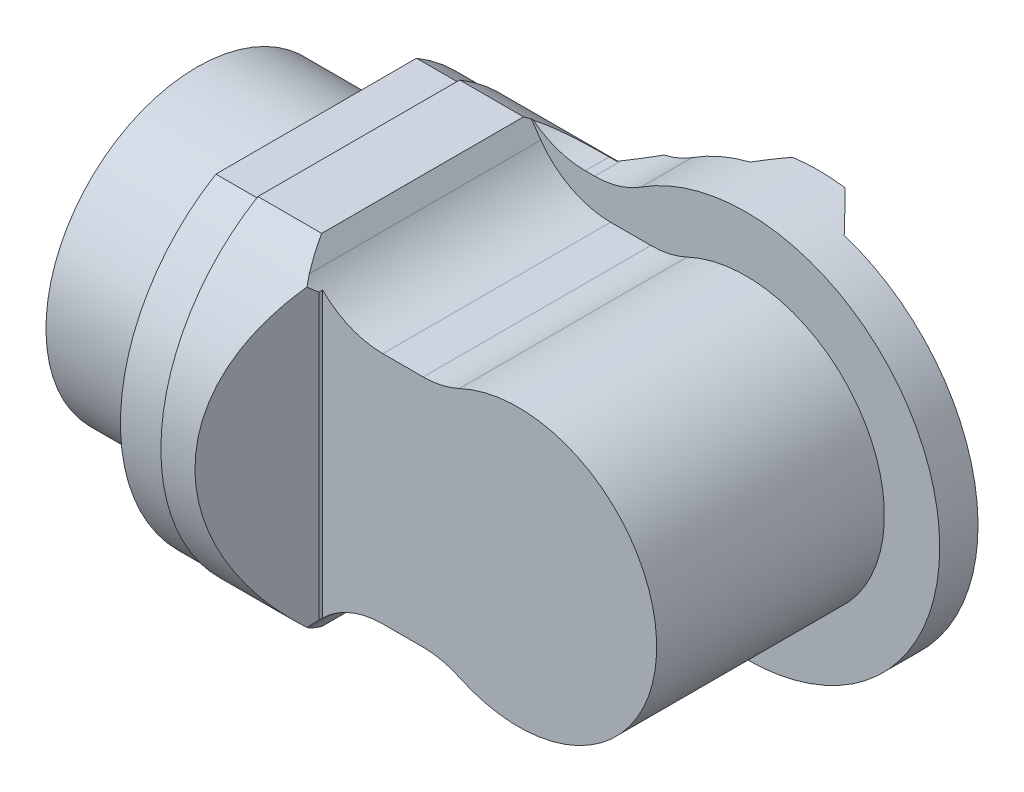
ISO-10303-21;
HEADER;
FILE_DESCRIPTION(('STEP AP214'),'2;1');
FILE_NAME('part.step','',(''),(''),'','','');
FILE_SCHEMA(('AUTOMOTIVE_DESIGN { 1 0 10303 214 1 1 1 1 }'));
ENDSEC;
DATA;
#1=APPLICATION_CONTEXT('core data for automotive mechanical design processes');
#2=APPLICATION_PROTOCOL_DEFINITION('international standard','automotive_design',2000,#1);
#3=PRODUCT_CONTEXT('',#1,'mechanical');
#4=PRODUCT('Part','Part','',(#3));
#5=PRODUCT_RELATED_PRODUCT_CATEGORY('part','',(#4));
#6=PRODUCT_DEFINITION_FORMATION('','',#4);
#7=PRODUCT_DEFINITION_CONTEXT('part definition',#1,'design');
#8=PRODUCT_DEFINITION('design','',#6,#7);
#9=PRODUCT_DEFINITION_SHAPE('','',#8);
#10=(LENGTH_UNIT() NAMED_UNIT(*) SI_UNIT(.MILLI.,.METRE.));
#11=(NAMED_UNIT(*) PLANE_ANGLE_UNIT() SI_UNIT($,.RADIAN.));
#12=(NAMED_UNIT(*) SI_UNIT($,.STERADIAN.) SOLID_ANGLE_UNIT());
#13=UNCERTAINTY_MEASURE_WITH_UNIT(LENGTH_MEASURE(1.E-05),#10,'distance_accuracy_value','');
#14=(GEOMETRIC_REPRESENTATION_CONTEXT(3) GLOBAL_UNCERTAINTY_ASSIGNED_CONTEXT((#13)) GLOBAL_UNIT_ASSIGNED_CONTEXT((#10,
#11,#12)) REPRESENTATION_CONTEXT('',''));
#15=CARTESIAN_POINT('',(0.,0.,0.));
#16=DIRECTION('',(0.,0.,1.));
#17=DIRECTION('',(1.,0.,0.));
#18=AXIS2_PLACEMENT_3D('',#15,#16,#17);
#19=CARTESIAN_POINT('',(0.,0.,0.));
#20=DIRECTION('',(1.,0.,0.));
#21=DIRECTION('',(0.,1.,0.));
#22=AXIS2_PLACEMENT_3D('',#19,#20,#21);
#23=CYLINDRICAL_SURFACE('',#22,46.);
#24=DIRECTION('',(1.,0.,0.));
#25=VECTOR('',#24,1.);
#26=CARTESIAN_POINT('',(-76.,-39.5000000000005,23.5743504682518));
#27=LINE('',#26,#25);
#28=CARTESIAN_POINT('',(-76.,-39.5000000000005,23.5743504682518));
#29=VERTEX_POINT('',#28);
#30=CARTESIAN_POINT('',(-66.,-39.5000000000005,23.5743504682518));
#31=VERTEX_POINT('',#30);
#32=EDGE_CURVE('E265',#29,#31,#27,.T.);
#33=ORIENTED_EDGE('',*,*,#32,.T.);
#34=CARTESIAN_POINT('',(-66.,0.,0.));
#35=DIRECTION('',(1.,0.,0.));
#36=DIRECTION('',(0.,1.,0.));
#37=AXIS2_PLACEMENT_3D('',#34,#35,#36);
#38=CIRCLE('',#37,46.);
#39=CARTESIAN_POINT('',(-66.,39.5,23.5743504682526));
#40=VERTEX_POINT('',#39);
#41=EDGE_CURVE('E270',#40,#31,#38,.T.);
#42=ORIENTED_EDGE('',*,*,#41,.F.);
#43=DIRECTION('',(1.,0.,0.));
#44=VECTOR('',#43,1.);
#45=CARTESIAN_POINT('',(-76.,39.5,23.5743504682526));
#46=LINE('',#45,#44);
#47=CARTESIAN_POINT('',(-76.,39.5,23.5743504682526));
#48=VERTEX_POINT('',#47);
#49=EDGE_CURVE('E278',#48,#40,#46,.T.);
#50=ORIENTED_EDGE('',*,*,#49,.F.);
#51=CARTESIAN_POINT('',(-76.,0.,0.));
#52=DIRECTION('',(1.,0.,0.));
#53=DIRECTION('',(0.,1.,0.));
#54=AXIS2_PLACEMENT_3D('',#51,#52,#53);
#55=CIRCLE('',#54,46.);
#56=EDGE_CURVE('E282',#48,#29,#55,.T.);
#57=ORIENTED_EDGE('',*,*,#56,.T.);
#58=EDGE_LOOP('',(#33,#42,#50,#57));
#59=FACE_BOUND('',#58,.T.);
#60=ADVANCED_FACE('F16',(#59),#23,.T.);
#61=CARTESIAN_POINT('',(-37.7712434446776,35.,-37.));
#62=DIRECTION('',(0.,1.,0.));
#63=DIRECTION('',(0.,0.,1.));
#64=AXIS2_PLACEMENT_3D('',#61,#62,#63);
#65=PLANE('',#64);
#66=CARTESIAN_POINT('',(-45.2435921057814,35.,-12.7687089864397));
#67=CARTESIAN_POINT('',(-45.0952913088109,35.,-13.2014127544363));
#68=CARTESIAN_POINT('',(-44.9410531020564,35.,-13.6320438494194));
#69=CARTESIAN_POINT('',(-44.6215473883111,35.,-14.4891446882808));
#70=CARTESIAN_POINT('',(-44.4562810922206,35.,-14.9156148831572));
#71=CARTESIAN_POINT('',(-43.9453898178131,35.,-16.188322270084));
#72=CARTESIAN_POINT('',(-43.5844677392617,35.,-17.028446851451));
#73=CARTESIAN_POINT('',(-42.8289657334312,35.,-18.6905738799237));
#74=CARTESIAN_POINT('',(-42.4344785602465,35.,-19.512618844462));
#75=CARTESIAN_POINT('',(-41.6161220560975,35.,-21.1420888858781));
#76=CARTESIAN_POINT('',(-41.1922473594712,35.,-21.9495112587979));
#77=CARTESIAN_POINT('',(-40.322489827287,35.,-23.5454239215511));
#78=CARTESIAN_POINT('',(-39.876771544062,35.,-24.334004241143));
#79=CARTESIAN_POINT('',(-38.964366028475,35.,-25.8989488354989));
#80=CARTESIAN_POINT('',(-38.4976779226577,35.,-26.6753125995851));
#81=CARTESIAN_POINT('',(-37.5460300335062,35.,-28.2175092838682));
#82=CARTESIAN_POINT('',(-37.0610572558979,35.,-28.9833341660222));
#83=CARTESIAN_POINT('',(-36.075675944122,35.,-30.5049822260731));
#84=CARTESIAN_POINT('',(-35.5752672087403,35.,-31.2608052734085));
#85=CARTESIAN_POINT('',(-34.564399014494,35.,-32.7585897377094));
#86=CARTESIAN_POINT('',(-34.0540253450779,35.,-33.5006091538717));
#87=CARTESIAN_POINT('',(-33.0218518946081,35.,-34.9766412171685));
#88=CARTESIAN_POINT('',(-32.5000521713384,35.,-35.7106539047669));
#89=CARTESIAN_POINT('',(-31.446623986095,35.,-37.1712660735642));
#90=CARTESIAN_POINT('',(-30.9149983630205,35.,-37.8978676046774));
#91=CARTESIAN_POINT('',(-29.8429924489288,35.,-39.3445849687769));
#92=CARTESIAN_POINT('',(-29.3026120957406,35.,-40.0647007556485));
#93=CARTESIAN_POINT('',(-28.2105791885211,35.,-41.5037616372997));
#94=CARTESIAN_POINT('',(-27.6588760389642,35.,-42.2226683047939));
#95=CARTESIAN_POINT('',(-26.5485497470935,35.,-43.655119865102));
#96=CARTESIAN_POINT('',(-25.9899265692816,35.,-44.3686647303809));
#97=CARTESIAN_POINT('',(-24.8665214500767,35.,-45.790918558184));
#98=CARTESIAN_POINT('',(-24.3017393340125,35.,-46.4996273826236));
#99=CARTESIAN_POINT('',(-23.1666871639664,35.,-47.9126110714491));
#100=CARTESIAN_POINT('',(-22.5964172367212,35.,-48.6168860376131));
#101=CARTESIAN_POINT('',(-22.0237179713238,35.,-49.3191716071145));
#102=B_SPLINE_CURVE_WITH_KNOTS('',3,(#66,#67,#68,#69,#70,#71,#72,#73,#74,#75,#76,#77,#78,#79,
#80,#81,#82,#83,#84,#85,#86,#87,#88,#89,#90,#91,#92,#93,#94,#95,#96,#97,#98,#99,#100,#101),
.UNSPECIFIED.,.F.,.F.,(4,2,2,2,2,2,2,2,2,2,2,2,2,2,2,2,2,4),(0.,1.37213342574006,
2.74411643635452,5.4862093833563,8.22095669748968,10.9562046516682,13.6733173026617,
16.3905432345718,19.1097380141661,21.8289682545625,24.5306357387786,27.2322895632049,
29.9331746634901,32.634078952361,35.3526396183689,38.071214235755,40.7898661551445,
43.5084554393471),.UNSPECIFIED.);
#103=CARTESIAN_POINT('',(-36.,35.,-30.6145390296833));
#104=VERTEX_POINT('',#103);
#105=CARTESIAN_POINT('',(-35.5703528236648,35.,-31.2632657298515));
#106=VERTEX_POINT('',#105);
#107=EDGE_CURVE('E337',#104,#106,#102,.T.);
#108=ORIENTED_EDGE('',*,*,#107,.F.);
#109=DIRECTION('',(-1.,0.,0.));
#110=VECTOR('',#109,1.);
#111=CARTESIAN_POINT('',(-36.,35.,-30.6145390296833));
#112=LINE('',#111,#110);
#113=CARTESIAN_POINT('',(-37.7712434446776,35.,-30.6145390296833));
#114=VERTEX_POINT('',#113);
#115=EDGE_CURVE('E382',#114,#104,#112,.F.);
#116=ORIENTED_EDGE('',*,*,#115,.F.);
#117=DIRECTION('',(0.,0.,1.));
#118=VECTOR('',#117,1.);
#119=CARTESIAN_POINT('',(-37.7712434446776,35.,-37.));
#120=LINE('',#119,#118);
#121=CARTESIAN_POINT('',(-37.7712434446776,35.,-25.));
#122=VERTEX_POINT('',#121);
#123=EDGE_CURVE('E464',#114,#122,#120,.T.);
#124=ORIENTED_EDGE('',*,*,#123,.T.);
#125=DIRECTION('',(1.,0.,0.));
#126=VECTOR('',#125,1.);
#127=CARTESIAN_POINT('',(-37.7712434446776,35.,-25.));
#128=LINE('',#127,#126);
#129=CARTESIAN_POINT('',(-35.5703528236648,35.,-25.));
#130=VERTEX_POINT('',#129);
#131=EDGE_CURVE('E511',#122,#130,#128,.T.);
#132=ORIENTED_EDGE('',*,*,#131,.T.);
#133=DIRECTION('',(0.,0.,1.));
#134=VECTOR('',#133,1.);
#135=CARTESIAN_POINT('',(-35.5703528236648,35.,-37.));
#136=LINE('',#135,#134);
#137=EDGE_CURVE('E467',#106,#130,#136,.T.);
#138=ORIENTED_EDGE('',*,*,#137,.F.);
#139=EDGE_LOOP('',(#108,#116,#124,#132,#138));
#140=FACE_BOUND('',#139,.T.);
#141=ADVANCED_FACE('F498',(#140),#65,.T.);
#142=CARTESIAN_POINT('',(-35.5703528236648,55.,-37.));
#143=DIRECTION('',(0.,0.,1.));
#144=DIRECTION('',(1.,0.,0.));
#145=AXIS2_PLACEMENT_3D('',#142,#143,#144);
#146=CYLINDRICAL_SURFACE('',#145,20.);
#147=CARTESIAN_POINT('',(-35.5705528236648,35.000000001,-31.2629655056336));
#148=CARTESIAN_POINT('',(-35.2369706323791,35.0000140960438,-31.7636940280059));
#149=CARTESIAN_POINT('',(-34.8959706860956,35.0083398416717,-32.2595644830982));
#150=CARTESIAN_POINT('',(-34.2006524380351,35.0439227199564,-33.2395821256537));
#151=CARTESIAN_POINT('',(-33.8463640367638,35.0711395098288,-33.7237520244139));
#152=CARTESIAN_POINT('',(-33.1245405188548,35.146794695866,-34.6805261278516));
#153=CARTESIAN_POINT('',(-32.7570047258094,35.1952341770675,-35.1531297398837));
#154=CARTESIAN_POINT('',(-32.0087810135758,35.3160282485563,-36.0863226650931));
#155=CARTESIAN_POINT('',(-31.6280666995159,35.3884336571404,-36.5468841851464));
#156=CARTESIAN_POINT('',(-31.2415890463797,35.4740735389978,-37.0002));
#157=B_SPLINE_CURVE_WITH_KNOTS('',3,(#147,#148,#149,#150,#151,#152,#153,#154,#155,#156),
.UNSPECIFIED.,.F.,.F.,(4,2,2,2,4),(0.,1.80498591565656,3.60612900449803,5.40736418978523,
7.21244351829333),.UNSPECIFIED.);
#158=CARTESIAN_POINT('',(-31.2417595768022,35.4740357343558,-37.));
#159=VERTEX_POINT('',#158);
#160=EDGE_CURVE('E310',#106,#159,#157,.T.);
#161=ORIENTED_EDGE('',*,*,#160,.F.);
#162=ORIENTED_EDGE('',*,*,#137,.T.);
#163=CARTESIAN_POINT('',(-35.5703528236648,55.,-25.));
#164=DIRECTION('',(0.,0.,1.));
#165=DIRECTION('',(1.,0.,0.));
#166=AXIS2_PLACEMENT_3D('',#163,#164,#165);
#167=CIRCLE('',#166,20.);
#168=CARTESIAN_POINT('',(-24.709176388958,38.206106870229,-25.));
#169=VERTEX_POINT('',#168);
#170=EDGE_CURVE('E565',#130,#169,#167,.T.);
#171=ORIENTED_EDGE('',*,*,#170,.T.);
#172=DIRECTION('',(0.,0.,1.));
#173=VECTOR('',#172,1.);
#174=CARTESIAN_POINT('',(-24.709176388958,38.206106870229,-37.));
#175=LINE('',#174,#173);
#176=CARTESIAN_POINT('',(-24.709176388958,38.206106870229,-37.));
#177=VERTEX_POINT('',#176);
#178=EDGE_CURVE('E469',#177,#169,#175,.T.);
#179=ORIENTED_EDGE('',*,*,#178,.F.);
#180=CARTESIAN_POINT('',(-35.5703528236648,55.,-37.));
#181=DIRECTION('',(0.,0.,-1.));
#182=DIRECTION('',(1.,0.,0.));
#183=AXIS2_PLACEMENT_3D('',#180,#181,#182);
#184=CIRCLE('',#183,20.);
#185=EDGE_CURVE('E455',#177,#159,#184,.T.);
#186=ORIENTED_EDGE('',*,*,#185,.T.);
#187=EDGE_LOOP('',(#161,#162,#171,#179,#186));
#188=FACE_BOUND('',#187,.T.);
#189=ADVANCED_FACE('F572',(#188),#146,.F.);
#190=CARTESIAN_POINT('',(0.,0.,-37.));
#191=DIRECTION('',(0.,0.,1.));
#192=DIRECTION('',(1.,0.,0.));
#193=AXIS2_PLACEMENT_3D('',#190,#191,#192);
#194=CYLINDRICAL_SURFACE('',#193,45.5);
#195=CARTESIAN_POINT('',(0.,0.,-37.));
#196=DIRECTION('',(0.,0.,1.));
#197=DIRECTION('',(1.,0.,0.));
#198=AXIS2_PLACEMENT_3D('',#195,#196,#197);
#199=CIRCLE('',#198,45.5);
#200=CARTESIAN_POINT('',(-24.709176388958,-38.206106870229,-37.));
#201=VERTEX_POINT('',#200);
#202=CARTESIAN_POINT('',(-16.8828473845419,-42.2518575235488,-37.));
#203=VERTEX_POINT('',#202);
#204=EDGE_CURVE('E453',#201,#203,#199,.T.);
#205=ORIENTED_EDGE('',*,*,#204,.T.);
#206=CARTESIAN_POINT('',(0.,0.,-34.));
#207=DIRECTION('',(-0.672498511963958,0.218508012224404,0.707106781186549));
#208=DIRECTION('',(0.672498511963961,-0.218508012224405,0.707106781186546));
#209=AXIS2_PLACEMENT_3D('',#206,#207,#208);
#210=ELLIPSE('',#209,64.3467170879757,45.5);
#211=CARTESIAN_POINT('',(-14.0602732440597,-43.2730714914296,-34.));
#212=VERTEX_POINT('',#211);
#213=EDGE_CURVE('E11',#203,#212,#210,.T.);
#214=ORIENTED_EDGE('',*,*,#213,.T.);
#215=CARTESIAN_POINT('',(0.,0.,-34.));
#216=DIRECTION('',(0.,0.,-1.));
#217=DIRECTION('',(0.,1.,0.));
#218=AXIS2_PLACEMENT_3D('',#215,#216,#217);
#219=CIRCLE('',#218,45.5);
#220=CARTESIAN_POINT('',(14.0602732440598,43.2730714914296,-34.));
#221=VERTEX_POINT('',#220);
#222=EDGE_CURVE('E296',#221,#212,#219,.T.);
#223=ORIENTED_EDGE('',*,*,#222,.F.);
#224=CARTESIAN_POINT('',(0.,0.,-34.));
#225=DIRECTION('',(0.672498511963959,-0.218508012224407,-0.707106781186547));
#226=DIRECTION('',(0.672498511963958,-0.218508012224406,0.707106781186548));
#227=AXIS2_PLACEMENT_3D('',#224,#225,#226);
#228=ELLIPSE('',#227,64.3467170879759,45.5);
#229=CARTESIAN_POINT('',(6.23278435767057,45.0710816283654,-42.));
#230=VERTEX_POINT('',#229);
#231=EDGE_CURVE('E599',#221,#230,#228,.F.);
#232=ORIENTED_EDGE('',*,*,#231,.T.);
#233=CARTESIAN_POINT('',(0.,0.,-42.));
#234=DIRECTION('',(0.,0.,-1.));
#235=DIRECTION('',(0.,1.,0.));
#236=AXIS2_PLACEMENT_3D('',#233,#234,#235);
#237=CIRCLE('',#236,45.5);
#238=CARTESIAN_POINT('',(-6.08930369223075,45.0906906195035,-42.));
#239=VERTEX_POINT('',#238);
#240=EDGE_CURVE('E445',#239,#230,#237,.T.);
#241=ORIENTED_EDGE('',*,*,#240,.F.);
#242=CARTESIAN_POINT('',(0.,0.,-37.));
#243=DIRECTION('',(-0.686102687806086,-0.171064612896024,-0.707106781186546));
#244=DIRECTION('',(-0.686102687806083,-0.171064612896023,0.707106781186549));
#245=AXIS2_PLACEMENT_3D('',#242,#243,#244);
#246=ELLIPSE('',#245,64.3467170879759,45.5);
#247=CARTESIAN_POINT('',(-11.0074462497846,44.1484555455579,-37.));
#248=VERTEX_POINT('',#247);
#249=EDGE_CURVE('E578',#239,#248,#246,.F.);
#250=ORIENTED_EDGE('',*,*,#249,.T.);
#251=EDGE_CURVE('E452',#248,#177,#199,.T.);
#252=ORIENTED_EDGE('',*,*,#251,.T.);
#253=ORIENTED_EDGE('',*,*,#178,.T.);
#254=CARTESIAN_POINT('',(0.,0.,-25.));
#255=DIRECTION('',(0.,0.,1.));
#256=DIRECTION('',(1.,0.,0.));
#257=AXIS2_PLACEMENT_3D('',#254,#255,#256);
#258=CIRCLE('',#257,45.5);
#259=CARTESIAN_POINT('',(-24.709176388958,-38.206106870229,-25.));
#260=VERTEX_POINT('',#259);
#261=EDGE_CURVE('E562',#169,#260,#258,.F.);
#262=ORIENTED_EDGE('',*,*,#261,.T.);
#263=DIRECTION('',(0.,0.,1.));
#264=VECTOR('',#263,1.);
#265=CARTESIAN_POINT('',(-24.709176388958,-38.206106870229,-37.));
#266=LINE('',#265,#264);
#267=EDGE_CURVE('E472',#201,#260,#266,.T.);
#268=ORIENTED_EDGE('',*,*,#267,.F.);
#269=EDGE_LOOP('',(#205,#214,#223,#232,#241,#250,#252,#253,#262,#268));
#270=FACE_BOUND('',#269,.T.);
#271=ADVANCED_FACE('F359',(#270),#194,.T.);
#272=CARTESIAN_POINT('',(-35.5703528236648,-55.,-37.));
#273=DIRECTION('',(0.,0.,1.));
#274=DIRECTION('',(1.,0.,0.));
#275=AXIS2_PLACEMENT_3D('',#272,#273,#274);
#276=CYLINDRICAL_SURFACE('',#275,20.);
#277=CARTESIAN_POINT('',(-31.2415890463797,-35.4740735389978,-37.0002));
#278=CARTESIAN_POINT('',(-31.6280666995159,-35.3884336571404,-36.5468841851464));
#279=CARTESIAN_POINT('',(-32.0087810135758,-35.3160282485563,-36.0863226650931));
#280=CARTESIAN_POINT('',(-32.7570047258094,-35.1952341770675,-35.1531297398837));
#281=CARTESIAN_POINT('',(-33.1245405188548,-35.146794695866,-34.6805261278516));
#282=CARTESIAN_POINT('',(-33.8463640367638,-35.0711395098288,-33.7237520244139));
#283=CARTESIAN_POINT('',(-34.2006524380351,-35.0439227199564,-33.2395821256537));
#284=CARTESIAN_POINT('',(-34.8959706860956,-35.0083398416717,-32.2595644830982));
#285=CARTESIAN_POINT('',(-35.236970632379,-35.0000140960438,-31.763694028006));
#286=CARTESIAN_POINT('',(-35.5705528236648,-35.000000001,-31.2629655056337));
#287=B_SPLINE_CURVE_WITH_KNOTS('',3,(#277,#278,#279,#280,#281,#282,#283,#284,#285,#286),
.UNSPECIFIED.,.F.,.F.,(4,2,2,2,4),(0.,1.8050793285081,3.60631451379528,5.40745760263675,
7.21244351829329),.UNSPECIFIED.);
#288=CARTESIAN_POINT('',(-31.2417595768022,-35.4740357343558,-37.));
#289=VERTEX_POINT('',#288);
#290=CARTESIAN_POINT('',(-35.5703528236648,-35.,-31.2632657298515));
#291=VERTEX_POINT('',#290);
#292=EDGE_CURVE('E343',#289,#291,#287,.T.);
#293=ORIENTED_EDGE('',*,*,#292,.F.);
#294=CARTESIAN_POINT('',(-35.5703528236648,-55.,-37.));
#295=DIRECTION('',(0.,0.,-1.));
#296=DIRECTION('',(1.,0.,0.));
#297=AXIS2_PLACEMENT_3D('',#294,#295,#296);
#298=CIRCLE('',#297,20.);
#299=EDGE_CURVE('E450',#289,#201,#298,.T.);
#300=ORIENTED_EDGE('',*,*,#299,.T.);
#301=ORIENTED_EDGE('',*,*,#267,.T.);
#302=CARTESIAN_POINT('',(-35.5703528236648,-55.,-25.));
#303=DIRECTION('',(0.,0.,1.));
#304=DIRECTION('',(1.,0.,0.));
#305=AXIS2_PLACEMENT_3D('',#302,#303,#304);
#306=CIRCLE('',#305,20.);
#307=CARTESIAN_POINT('',(-35.5703528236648,-35.,-25.));
#308=VERTEX_POINT('',#307);
#309=EDGE_CURVE('E559',#260,#308,#306,.T.);
#310=ORIENTED_EDGE('',*,*,#309,.T.);
#311=DIRECTION('',(0.,0.,1.));
#312=VECTOR('',#311,1.);
#313=CARTESIAN_POINT('',(-35.5703528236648,-35.,-37.));
#314=LINE('',#313,#312);
#315=EDGE_CURVE('E475',#291,#308,#314,.T.);
#316=ORIENTED_EDGE('',*,*,#315,.F.);
#317=EDGE_LOOP('',(#293,#300,#301,#310,#316));
#318=FACE_BOUND('',#317,.T.);
#319=ADVANCED_FACE('F354',(#318),#276,.F.);
#320=CARTESIAN_POINT('',(-37.7712434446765,-35.,-37.));
#321=DIRECTION('',(0.,-1.,0.));
#322=DIRECTION('',(0.,0.,-1.));
#323=AXIS2_PLACEMENT_3D('',#320,#321,#322);
#324=PLANE('',#323);
#325=CARTESIAN_POINT('',(-22.0237179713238,-35.,-49.3191716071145));
#326=CARTESIAN_POINT('',(-22.5964172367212,-35.,-48.6168860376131));
#327=CARTESIAN_POINT('',(-23.1666871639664,-35.,-47.9126110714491));
#328=CARTESIAN_POINT('',(-24.3017393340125,-35.,-46.4996273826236));
#329=CARTESIAN_POINT('',(-24.8665214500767,-35.,-45.790918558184));
#330=CARTESIAN_POINT('',(-25.9899265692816,-35.,-44.3686647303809));
#331=CARTESIAN_POINT('',(-26.5485497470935,-35.,-43.655119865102));
#332=CARTESIAN_POINT('',(-27.6588760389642,-35.,-42.2226683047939));
#333=CARTESIAN_POINT('',(-28.2105791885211,-35.,-41.5037616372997));
#334=CARTESIAN_POINT('',(-29.3026120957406,-35.,-40.0647007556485));
#335=CARTESIAN_POINT('',(-29.8429924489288,-35.,-39.3445849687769));
#336=CARTESIAN_POINT('',(-30.9149983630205,-35.,-37.8978676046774));
#337=CARTESIAN_POINT('',(-31.446623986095,-35.,-37.1712660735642));
#338=CARTESIAN_POINT('',(-32.5000521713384,-35.,-35.7106539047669));
#339=CARTESIAN_POINT('',(-33.0218518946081,-35.,-34.9766412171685));
#340=CARTESIAN_POINT('',(-34.0540253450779,-35.,-33.5006091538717));
#341=CARTESIAN_POINT('',(-34.564399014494,-35.,-32.7585897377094));
#342=CARTESIAN_POINT('',(-35.5752672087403,-35.,-31.2608052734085));
#343=CARTESIAN_POINT('',(-36.075675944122,-35.,-30.5049822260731));
#344=CARTESIAN_POINT('',(-37.0610572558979,-35.,-28.9833341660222));
#345=CARTESIAN_POINT('',(-37.5460300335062,-35.,-28.2175092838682));
#346=CARTESIAN_POINT('',(-38.4976779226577,-35.,-26.6753125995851));
#347=CARTESIAN_POINT('',(-38.964366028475,-35.,-25.8989488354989));
#348=CARTESIAN_POINT('',(-39.876771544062,-35.,-24.334004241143));
#349=CARTESIAN_POINT('',(-40.322489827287,-35.,-23.5454239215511));
#350=CARTESIAN_POINT('',(-41.1922473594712,-35.,-21.9495112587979));
#351=CARTESIAN_POINT('',(-41.6161220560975,-35.,-21.1420888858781));
#352=CARTESIAN_POINT('',(-42.4344785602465,-35.,-19.512618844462));
#353=CARTESIAN_POINT('',(-42.8289657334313,-35.,-18.6905738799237));
#354=CARTESIAN_POINT('',(-43.5844677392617,-35.,-17.028446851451));
#355=CARTESIAN_POINT('',(-43.9453898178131,-35.,-16.188322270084));
#356=CARTESIAN_POINT('',(-44.4562810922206,-35.,-14.9156148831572));
#357=CARTESIAN_POINT('',(-44.6215473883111,-35.,-14.4891446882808));
#358=CARTESIAN_POINT('',(-44.9410531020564,-35.,-13.6320438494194));
#359=CARTESIAN_POINT('',(-45.0952913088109,-35.,-13.2014127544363));
#360=CARTESIAN_POINT('',(-45.2435921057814,-35.,-12.7687089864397));
#361=B_SPLINE_CURVE_WITH_KNOTS('',3,(#325,#326,#327,#328,#329,#330,#331,#332,#333,#334,#335,
#336,#337,#338,#339,#340,#341,#342,#343,#344,#345,#346,#347,#348,#349,#350,#351,#352,#353,#354,
#355,#356,#357,#358,#359,#360),.UNSPECIFIED.,.F.,.F.,(4,2,2,2,2,2,2,2,2,2,2,2,2,2,2,2,2,4),(0.,
2.71858928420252,5.43724120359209,8.15581582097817,10.8743764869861,13.5752807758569,
16.2761658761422,18.9778197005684,21.6794871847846,24.398717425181,27.1179122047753,
29.8351381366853,32.5522507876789,35.2874987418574,38.0222460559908,40.7643390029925,
42.136322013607,43.5084554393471),.UNSPECIFIED.);
#362=CARTESIAN_POINT('',(-36.,-35.,-30.6145390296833));
#363=VERTEX_POINT('',#362);
#364=EDGE_CURVE('E348',#291,#363,#361,.T.);
#365=ORIENTED_EDGE('',*,*,#364,.F.);
#366=ORIENTED_EDGE('',*,*,#315,.T.);
#367=DIRECTION('',(-1.,0.,0.));
#368=VECTOR('',#367,1.);
#369=CARTESIAN_POINT('',(-37.7712434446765,-35.,-25.));
#370=LINE('',#369,#368);
#371=CARTESIAN_POINT('',(-37.7712434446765,-35.,-25.));
#372=VERTEX_POINT('',#371);
#373=EDGE_CURVE('E556',#308,#372,#370,.T.);
#374=ORIENTED_EDGE('',*,*,#373,.T.);
#375=DIRECTION('',(0.,0.,1.));
#376=VECTOR('',#375,1.);
#377=CARTESIAN_POINT('',(-37.7712434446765,-35.,-37.));
#378=LINE('',#377,#376);
#379=CARTESIAN_POINT('',(-37.7712434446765,-35.,-30.6145390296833));
#380=VERTEX_POINT('',#379);
#381=EDGE_CURVE('E477',#380,#372,#378,.T.);
#382=ORIENTED_EDGE('',*,*,#381,.F.);
#383=DIRECTION('',(-1.,0.,0.));
#384=VECTOR('',#383,1.);
#385=CARTESIAN_POINT('',(-36.,-35.,-30.6145390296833));
#386=LINE('',#385,#384);
#387=EDGE_CURVE('E461',#363,#380,#386,.T.);
#388=ORIENTED_EDGE('',*,*,#387,.F.);
#389=EDGE_LOOP('',(#365,#366,#374,#382,#388));
#390=FACE_BOUND('',#389,.T.);
#391=ADVANCED_FACE('F358',(#390),#324,.T.);
#392=CARTESIAN_POINT('',(-37.7712434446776,55.,-37.));
#393=DIRECTION('',(0.,0.,1.));
#394=DIRECTION('',(1.,0.,0.));
#395=AXIS2_PLACEMENT_3D('',#392,#393,#394);
#396=CYLINDRICAL_SURFACE('',#395,20.);
#397=CARTESIAN_POINT('',(-36.,35.0785869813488,30.5244612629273));
#398=CARTESIAN_POINT('',(-36.1929804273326,35.0614265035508,30.5441792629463));
#399=CARTESIAN_POINT('',(-36.3865125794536,35.0470487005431,30.5606717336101));
#400=CARTESIAN_POINT('',(-36.7743514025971,35.0239158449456,30.5871812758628));
#401=CARTESIAN_POINT('',(-36.9686580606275,35.0151606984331,30.5971984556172));
#402=CARTESIAN_POINT('',(-37.5521000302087,34.9974193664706,30.6174959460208));
#403=CARTESIAN_POINT('',(-37.9419127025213,34.9969434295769,30.6180380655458));
#404=CARTESIAN_POINT('',(-38.7185186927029,35.018682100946,30.5931715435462));
#405=CARTESIAN_POINT('',(-39.1053178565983,35.0408097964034,30.5678623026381));
#406=CARTESIAN_POINT('',(-39.8744771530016,35.1071524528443,30.4916446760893));
#407=CARTESIAN_POINT('',(-40.2568373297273,35.1513671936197,30.4407365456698));
#408=CARTESIAN_POINT('',(-41.0142336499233,35.2609664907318,30.3137140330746));
#409=CARTESIAN_POINT('',(-41.3892700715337,35.3263502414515,30.23760061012));
#410=CARTESIAN_POINT('',(-42.129425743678,35.4769650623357,30.0607454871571));
#411=CARTESIAN_POINT('',(-42.4945443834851,35.5621973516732,29.9600022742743));
#412=CARTESIAN_POINT('',(-43.2125802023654,35.7508521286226,29.7346287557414));
#413=CARTESIAN_POINT('',(-43.5654944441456,35.8542789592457,29.6099927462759));
#414=CARTESIAN_POINT('',(-44.2570344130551,36.0773539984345,29.3377822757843));
#415=CARTESIAN_POINT('',(-44.5956600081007,36.1970023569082,29.190207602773));
#416=CARTESIAN_POINT('',(-45.2600033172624,36.451518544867,28.8717628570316));
#417=CARTESIAN_POINT('',(-45.5855764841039,36.5865143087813,28.7006940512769));
#418=CARTESIAN_POINT('',(-46.2192819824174,36.868509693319,28.3375339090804));
#419=CARTESIAN_POINT('',(-46.5274146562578,37.015509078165,28.1454429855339));
#420=CARTESIAN_POINT('',(-47.1255019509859,37.3192089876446,27.7414936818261));
#421=CARTESIAN_POINT('',(-47.4154518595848,37.4759120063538,27.5296302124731));
#422=CARTESIAN_POINT('',(-47.9766864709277,37.7967020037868,27.0875244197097));
#423=CARTESIAN_POINT('',(-48.2479673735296,37.9607904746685,26.8572783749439));
#424=CARTESIAN_POINT('',(-48.8898323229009,38.3693116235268,26.2721159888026));
#425=CARTESIAN_POINT('',(-49.2500558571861,38.6166189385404,25.9077870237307));
#426=CARTESIAN_POINT('',(-49.9317242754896,39.1160010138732,25.1474751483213));
#427=CARTESIAN_POINT('',(-50.2531553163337,39.3680774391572,24.7514810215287));
#428=CARTESIAN_POINT('',(-50.8594343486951,39.8720486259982,23.9311896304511));
#429=CARTESIAN_POINT('',(-51.144221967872,40.1239424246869,23.5068473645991));
#430=CARTESIAN_POINT('',(-51.6790296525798,40.6226838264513,22.6340493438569));
#431=CARTESIAN_POINT('',(-51.9290487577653,40.8695312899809,22.1855929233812));
#432=CARTESIAN_POINT('',(-52.3302879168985,41.2853290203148,21.3988162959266));
#433=CARTESIAN_POINT('',(-52.4893460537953,41.4564127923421,21.0655725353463));
#434=CARTESIAN_POINT('',(-52.7921798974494,41.7930814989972,20.3894838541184));
#435=CARTESIAN_POINT('',(-52.9359542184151,41.958665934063,20.0466380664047));
#436=CARTESIAN_POINT('',(-53.3459958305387,42.4458098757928,19.0050014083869));
#437=CARTESIAN_POINT('',(-53.5909453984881,42.7577214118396,18.2931839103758));
#438=CARTESIAN_POINT('',(-54.0322719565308,43.3502980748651,16.8409730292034));
#439=CARTESIAN_POINT('',(-54.2285733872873,43.6309142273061,16.1005372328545));
#440=CARTESIAN_POINT('',(-54.5795241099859,44.1564958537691,14.5975185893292));
#441=CARTESIAN_POINT('',(-54.7341736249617,44.4014615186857,13.8349358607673));
#442=CARTESIAN_POINT('',(-54.9647850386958,44.7816562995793,12.5361778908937));
#443=CARTESIAN_POINT('',(-55.0501701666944,44.9271023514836,12.00459796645));
#444=CARTESIAN_POINT('',(-55.2060971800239,45.1994619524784,10.9345041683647));
#445=CARTESIAN_POINT('',(-55.2766380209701,45.3263741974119,10.3959898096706));
#446=CARTESIAN_POINT('',(-55.4043629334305,45.5611997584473,9.3131172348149));
#447=CARTESIAN_POINT('',(-55.4615431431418,45.6691075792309,8.76875737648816));
#448=CARTESIAN_POINT('',(-55.5637583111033,45.8655229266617,7.6754336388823));
#449=CARTESIAN_POINT('',(-55.6087935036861,45.9540308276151,7.12646984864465));
#450=CARTESIAN_POINT('',(-55.687752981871,46.1114431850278,6.02451851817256));
#451=CARTESIAN_POINT('',(-55.7216687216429,46.1803325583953,5.47152821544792));
#452=CARTESIAN_POINT('',(-55.7791154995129,46.2982276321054,4.36289627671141));
#453=CARTESIAN_POINT('',(-55.8026464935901,46.3472332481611,3.80725462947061));
#454=CARTESIAN_POINT('',(-55.8398669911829,46.4252283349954,2.69431224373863));
#455=CARTESIAN_POINT('',(-55.8535577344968,46.4542203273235,2.13701172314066));
#456=CARTESIAN_POINT('',(-55.8714235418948,46.4921261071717,1.02157727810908));
#457=CARTESIAN_POINT('',(-55.8755986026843,46.5010398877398,0.46344335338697));
#458=CARTESIAN_POINT('',(-55.8745247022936,46.4987523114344,-0.660180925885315));
#459=CARTESIAN_POINT('',(-55.8691499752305,46.4872825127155,-1.22567063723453));
#460=CARTESIAN_POINT('',(-55.8486022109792,46.4437344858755,-2.35568100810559));
#461=CARTESIAN_POINT('',(-55.8334291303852,46.4116561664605,-2.92020166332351));
#462=CARTESIAN_POINT('',(-55.7929163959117,46.3269665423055,-4.04742763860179));
#463=CARTESIAN_POINT('',(-55.7675751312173,46.2743519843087,-4.6101326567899));
#464=CARTESIAN_POINT('',(-55.7061240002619,46.1487317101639,-5.73267162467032));
#465=CARTESIAN_POINT('',(-55.6700142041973,46.0757261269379,-6.29250559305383));
#466=CARTESIAN_POINT('',(-55.5862232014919,45.9096125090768,-7.40776726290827));
#467=CARTESIAN_POINT('',(-55.5385531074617,45.8165237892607,-7.96319867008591));
#468=CARTESIAN_POINT('',(-55.4305376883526,45.6104921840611,-9.06914556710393));
#469=CARTESIAN_POINT('',(-55.37019206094,45.4975488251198,-9.61966093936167));
#470=CARTESIAN_POINT('',(-55.2355158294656,45.2522425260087,-10.7144328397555));
#471=CARTESIAN_POINT('',(-55.161190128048,45.1198863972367,-11.2586914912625));
#472=CARTESIAN_POINT('',(-54.996962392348,44.8362693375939,-12.3398263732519));
#473=CARTESIAN_POINT('',(-54.9070617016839,44.6850100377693,-12.8767032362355));
#474=CARTESIAN_POINT('',(-54.6734876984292,44.3051056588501,-14.1381287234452));
#475=CARTESIAN_POINT('',(-54.5222081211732,44.0684868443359,-14.8589118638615));
#476=CARTESIAN_POINT('',(-54.1815666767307,43.5634782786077,-16.2801100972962));
#477=CARTESIAN_POINT('',(-53.9922061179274,43.2950896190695,-16.9805258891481));
#478=CARTESIAN_POINT('',(-53.5693946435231,42.7304167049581,-18.3551821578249));
#479=CARTESIAN_POINT('',(-53.336009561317,42.4341744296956,-19.029459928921));
#480=CARTESIAN_POINT('',(-52.818061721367,41.818381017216,-20.3470165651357));
#481=CARTESIAN_POINT('',(-52.5335159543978,41.4988376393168,-20.9903056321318));
#482=CARTESIAN_POINT('',(-51.9933938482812,40.9345285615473,-22.0652192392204));
#483=CARTESIAN_POINT('',(-51.7517794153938,40.6936898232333,-22.5059427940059));
#484=CARTESIAN_POINT('',(-51.2355161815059,40.2067831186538,-23.3646739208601));
#485=CARTESIAN_POINT('',(-50.96086905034,39.9607154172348,-23.7826826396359));
#486=CARTESIAN_POINT('',(-50.3765241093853,39.4676832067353,-24.5922022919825));
#487=CARTESIAN_POINT('',(-50.0668611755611,39.2207198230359,-24.9837389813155));
#488=CARTESIAN_POINT('',(-49.4105185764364,38.7305531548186,-25.7370559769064));
#489=CARTESIAN_POINT('',(-49.06384704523,38.4873490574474,-26.0988427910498));
#490=CARTESIAN_POINT('',(-48.4073307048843,38.0590940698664,-26.7182878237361));
#491=CARTESIAN_POINT('',(-48.1044293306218,37.8723125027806,-26.9821200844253));
#492=CARTESIAN_POINT('',(-47.4747237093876,37.507866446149,-27.4864820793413));
#493=CARTESIAN_POINT('',(-47.1479247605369,37.3301999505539,-27.7270169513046));
#494=CARTESIAN_POINT('',(-46.4710481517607,36.9873021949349,-28.1828111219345));
#495=CARTESIAN_POINT('',(-46.1209746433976,36.8220687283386,-28.3980749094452));
#496=CARTESIAN_POINT('',(-45.3987361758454,36.5073938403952,-28.8014873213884));
#497=CARTESIAN_POINT('',(-45.0265711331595,36.3579524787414,-28.9896358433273));
#498=CARTESIAN_POINT('',(-44.2591039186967,36.0771065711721,-29.3384210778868));
#499=CARTESIAN_POINT('',(-43.8636446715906,35.9458509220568,-29.4988330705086));
#500=CARTESIAN_POINT('',(-43.0548714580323,35.7059293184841,-29.7887911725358));
#501=CARTESIAN_POINT('',(-42.6415561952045,35.5972650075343,-29.9183350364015));
#502=CARTESIAN_POINT('',(-41.8007280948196,35.4053811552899,-30.1451666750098));
#503=CARTESIAN_POINT('',(-41.3732254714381,35.3221437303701,-30.2424771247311));
#504=CARTESIAN_POINT('',(-40.5076795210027,35.1832432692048,-30.4039605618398));
#505=CARTESIAN_POINT('',(-40.0696397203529,35.1275711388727,-30.4681444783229));
#506=CARTESIAN_POINT('',(-39.3282027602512,35.0584101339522,-30.5476610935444));
#507=CARTESIAN_POINT('',(-39.0264504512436,35.0371291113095,-30.5720470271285));
#508=CARTESIAN_POINT('',(-38.4214843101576,35.0082808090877,-30.6050773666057));
#509=CARTESIAN_POINT('',(-38.1182708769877,35.0007099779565,-30.6137258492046));
#510=CARTESIAN_POINT('',(-37.5116704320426,34.9993856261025,-30.6152429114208));
#511=CARTESIAN_POINT('',(-37.208283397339,35.005637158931,-30.6081057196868));
#512=CARTESIAN_POINT('',(-36.6027952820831,35.0318525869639,-30.5780857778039));
#513=CARTESIAN_POINT('',(-36.3006945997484,35.0518204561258,-30.555198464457));
#514=CARTESIAN_POINT('',(-36.,35.0785869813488,-30.5244612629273));
#515=B_SPLINE_CURVE_WITH_KNOTS('',3,(#397,#398,#399,#400,#401,#402,#403,#404,#405,#406,#407,
#408,#409,#410,#411,#412,#413,#414,#415,#416,#417,#418,#419,#420,#421,#422,#423,#424,#425,#426,
#427,#428,#429,#430,#431,#432,#433,#434,#435,#436,#437,#438,#439,#440,#441,#442,#443,#444,#445,
#446,#447,#448,#449,#450,#451,#452,#453,#454,#455,#456,#457,#458,#459,#460,#461,#462,#463,#464,
#465,#466,#467,#468,#469,#470,#471,#472,#473,#474,#475,#476,#477,#478,#479,#480,#481,#482,#483,
#484,#485,#486,#487,#488,#489,#490,#491,#492,#493,#494,#495,#496,#497,#498,#499,#500,#501,#502,
#503,#504,#505,#506,#507,#508,#509,#510,#511,#512,#513,#514),.UNSPECIFIED.,.F.,.F.,(4,2,2,2,2,2,
2,2,2,2,2,2,2,2,2,2,2,2,2,2,2,2,2,2,2,2,2,2,2,2,2,2,2,2,2,2,2,2,2,2,2,2,2,2,2,2,2,2,2,2,2,2,2,2,
2,2,2,2,4),(0.,0.584130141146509,1.16825052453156,2.33602260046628,3.49932133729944,
4.66260847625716,5.82585134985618,6.98916569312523,8.15275809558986,9.31636125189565,
10.4904948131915,11.6646053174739,12.8390188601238,14.013670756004,15.7178273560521,
17.4225903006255,19.1301269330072,20.8377107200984,22.0581711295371,23.2787421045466,
25.7201529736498,28.1653323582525,30.6104986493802,32.2830725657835,33.9557641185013,
35.6289385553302,37.3020807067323,38.9765057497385,40.650937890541,42.3251590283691,
43.9993807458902,45.695814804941,47.3922563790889,49.0889668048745,50.7856661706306,
52.480740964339,54.1758561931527,55.8703780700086,57.564753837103,59.88366026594,
62.2024870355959,64.5178733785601,66.8324921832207,68.5032070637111,70.1738375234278,
71.8428184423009,73.5114332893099,74.839188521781,76.1666502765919,77.4938758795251,
78.8211064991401,80.1586320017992,81.4962547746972,82.8329345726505,84.1691730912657,
85.0789626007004,85.9885164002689,86.8984027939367,87.8085529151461),.UNSPECIFIED.);
#516=CARTESIAN_POINT('',(-50.0433982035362,39.2077798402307,-25.));
#517=VERTEX_POINT('',#516);
#518=EDGE_CURVE('E381',#517,#114,#515,.T.);
#519=ORIENTED_EDGE('',*,*,#518,.F.);
#520=CARTESIAN_POINT('',(-37.7712434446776,55.,-25.));
#521=DIRECTION('',(0.,0.,1.));
#522=DIRECTION('',(1.,0.,0.));
#523=AXIS2_PLACEMENT_3D('',#520,#521,#522);
#524=CIRCLE('',#523,20.);
#525=EDGE_CURVE('E503',#517,#122,#524,.T.);
#526=ORIENTED_EDGE('',*,*,#525,.T.);
#527=ORIENTED_EDGE('',*,*,#123,.F.);
#528=EDGE_LOOP('',(#519,#526,#527));
#529=FACE_BOUND('',#528,.T.);
#530=ADVANCED_FACE('F364',(#529),#396,.F.);
#531=CARTESIAN_POINT('',(-37.7712434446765,-55.,-37.));
#532=DIRECTION('',(0.,0.,1.));
#533=DIRECTION('',(1.,0.,0.));
#534=AXIS2_PLACEMENT_3D('',#531,#532,#533);
#535=CYLINDRICAL_SURFACE('',#534,20.);
#536=ORIENTED_EDGE('',*,*,#381,.T.);
#537=CARTESIAN_POINT('',(-37.7712434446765,-55.,-25.));
#538=DIRECTION('',(0.,0.,1.));
#539=DIRECTION('',(1.,0.,0.));
#540=AXIS2_PLACEMENT_3D('',#537,#538,#539);
#541=CIRCLE('',#540,20.);
#542=CARTESIAN_POINT('',(-50.0433982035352,-39.2077798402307,-25.));
#543=VERTEX_POINT('',#542);
#544=EDGE_CURVE('E640',#372,#543,#541,.T.);
#545=ORIENTED_EDGE('',*,*,#544,.T.);
#546=CARTESIAN_POINT('',(-36.,-35.0785869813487,-30.5244612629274));
#547=CARTESIAN_POINT('',(-36.1929804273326,-35.0614265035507,-30.5441792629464));
#548=CARTESIAN_POINT('',(-36.3865125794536,-35.047048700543,-30.5606717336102));
#549=CARTESIAN_POINT('',(-36.7743514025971,-35.0239158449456,-30.5871812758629));
#550=CARTESIAN_POINT('',(-36.9686580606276,-35.015160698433,-30.5971984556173));
#551=CARTESIAN_POINT('',(-37.5521000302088,-34.9974193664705,-30.6174959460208));
#552=CARTESIAN_POINT('',(-37.9419127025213,-34.9969434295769,-30.6180380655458));
#553=CARTESIAN_POINT('',(-38.718518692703,-35.0186821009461,-30.5931715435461));
#554=CARTESIAN_POINT('',(-39.1053178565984,-35.0408097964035,-30.5678623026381));
#555=CARTESIAN_POINT('',(-39.8744771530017,-35.1071524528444,-30.4916446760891));
#556=CARTESIAN_POINT('',(-40.2568373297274,-35.1513671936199,-30.4407365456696));
#557=CARTESIAN_POINT('',(-41.0142336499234,-35.260966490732,-30.3137140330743));
#558=CARTESIAN_POINT('',(-41.3892700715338,-35.3263502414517,-30.2376006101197));
#559=CARTESIAN_POINT('',(-42.1294257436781,-35.4769650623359,-30.0607454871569));
#560=CARTESIAN_POINT('',(-42.4945443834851,-35.5621973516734,-29.960002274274));
#561=CARTESIAN_POINT('',(-43.2125802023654,-35.7508521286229,-29.734628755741));
#562=CARTESIAN_POINT('',(-43.5654944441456,-35.854278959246,-29.6099927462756));
#563=CARTESIAN_POINT('',(-44.257034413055,-36.0773539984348,-29.3377822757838));
#564=CARTESIAN_POINT('',(-44.5956600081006,-36.1970023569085,-29.1902076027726));
#565=CARTESIAN_POINT('',(-45.2600033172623,-36.4515185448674,-28.8717628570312));
#566=CARTESIAN_POINT('',(-45.5855764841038,-36.5865143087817,-28.7006940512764));
#567=CARTESIAN_POINT('',(-46.2192819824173,-36.8685096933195,-28.3375339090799));
#568=CARTESIAN_POINT('',(-46.5274146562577,-37.0155090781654,-28.1454429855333));
#569=CARTESIAN_POINT('',(-47.1255019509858,-37.3192089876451,-27.7414936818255));
#570=CARTESIAN_POINT('',(-47.4154518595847,-37.4759120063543,-27.5296302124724));
#571=CARTESIAN_POINT('',(-47.9766864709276,-37.7967020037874,-27.087524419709));
#572=CARTESIAN_POINT('',(-48.2479673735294,-37.960790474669,-26.8572783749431));
#573=CARTESIAN_POINT('',(-48.8898323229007,-38.3693116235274,-26.2721159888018));
#574=CARTESIAN_POINT('',(-49.250055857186,-38.616618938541,-25.9077870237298));
#575=CARTESIAN_POINT('',(-49.9317242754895,-39.1160010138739,-25.1474751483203));
#576=CARTESIAN_POINT('',(-50.2531553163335,-39.3680774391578,-24.7514810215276));
#577=CARTESIAN_POINT('',(-50.8594343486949,-39.8720486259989,-23.93118963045));
#578=CARTESIAN_POINT('',(-51.1442219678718,-40.1239424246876,-23.5068473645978));
#579=CARTESIAN_POINT('',(-51.6790296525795,-40.622683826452,-22.6340493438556));
#580=CARTESIAN_POINT('',(-51.929048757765,-40.8695312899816,-22.1855929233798));
#581=CARTESIAN_POINT('',(-52.3302879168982,-41.2853290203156,-21.3988162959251));
#582=CARTESIAN_POINT('',(-52.489346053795,-41.4564127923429,-21.0655725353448));
#583=CARTESIAN_POINT('',(-52.7921798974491,-41.793081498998,-20.3894838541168));
#584=CARTESIAN_POINT('',(-52.9359542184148,-41.9586659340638,-20.046638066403));
#585=CARTESIAN_POINT('',(-53.3459958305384,-42.4458098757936,-19.0050014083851));
#586=CARTESIAN_POINT('',(-53.5909453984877,-42.7577214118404,-18.2931839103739));
#587=CARTESIAN_POINT('',(-54.0322719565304,-43.3502980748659,-16.8409730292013));
#588=CARTESIAN_POINT('',(-54.2285733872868,-43.6309142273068,-16.1005372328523));
#589=CARTESIAN_POINT('',(-54.5795241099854,-44.1564958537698,-14.5975185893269));
#590=CARTESIAN_POINT('',(-54.7341736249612,-44.4014615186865,-13.8349358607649));
#591=CARTESIAN_POINT('',(-54.9647850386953,-44.78165629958,-12.5361778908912));
#592=CARTESIAN_POINT('',(-55.0501701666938,-44.9271023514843,-12.0045979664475));
#593=CARTESIAN_POINT('',(-55.2060971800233,-45.199461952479,-10.9345041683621));
#594=CARTESIAN_POINT('',(-55.2766380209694,-45.3263741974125,-10.395989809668));
#595=CARTESIAN_POINT('',(-55.4043629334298,-45.5611997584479,-9.31311723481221));
#596=CARTESIAN_POINT('',(-55.461543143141,-45.6691075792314,-8.76875737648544));
#597=CARTESIAN_POINT('',(-55.5637583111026,-45.8655229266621,-7.67543363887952));
#598=CARTESIAN_POINT('',(-55.6087935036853,-45.9540308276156,-7.12646984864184));
#599=CARTESIAN_POINT('',(-55.6877529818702,-46.1114431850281,-6.02451851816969));
#600=CARTESIAN_POINT('',(-55.7216687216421,-46.1803325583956,-5.47152821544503));
#601=CARTESIAN_POINT('',(-55.779115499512,-46.2982276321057,-4.36289627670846));
#602=CARTESIAN_POINT('',(-55.8026464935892,-46.3472332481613,-3.80725462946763));
#603=CARTESIAN_POINT('',(-55.839866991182,-46.4252283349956,-2.69431224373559));
#604=CARTESIAN_POINT('',(-55.8535577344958,-46.4542203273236,-2.13701172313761));
#605=CARTESIAN_POINT('',(-55.8714235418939,-46.4921261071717,-1.02157727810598));
#606=CARTESIAN_POINT('',(-55.8755986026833,-46.5010398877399,-0.463443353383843));
#607=CARTESIAN_POINT('',(-55.8745247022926,-46.4987523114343,0.660180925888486));
#608=CARTESIAN_POINT('',(-55.8691499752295,-46.4872825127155,1.22567063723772));
#609=CARTESIAN_POINT('',(-55.8486022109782,-46.4437344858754,2.35568100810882));
#610=CARTESIAN_POINT('',(-55.8334291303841,-46.4116561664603,2.92020166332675));
#611=CARTESIAN_POINT('',(-55.7929163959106,-46.3269665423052,4.04742763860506));
#612=CARTESIAN_POINT('',(-55.7675751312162,-46.2743519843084,4.61013265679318));
#613=CARTESIAN_POINT('',(-55.7061240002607,-46.1487317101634,5.73267162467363));
#614=CARTESIAN_POINT('',(-55.670014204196,-46.0757261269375,6.29250559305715));
#615=CARTESIAN_POINT('',(-55.5862232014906,-45.9096125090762,7.40776726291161));
#616=CARTESIAN_POINT('',(-55.5385531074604,-45.8165237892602,7.96319867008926));
#617=CARTESIAN_POINT('',(-55.4305376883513,-45.6104921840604,9.06914556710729));
#618=CARTESIAN_POINT('',(-55.3701920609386,-45.4975488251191,9.61966093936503));
#619=CARTESIAN_POINT('',(-55.2355158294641,-45.2522425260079,10.7144328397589));
#620=CARTESIAN_POINT('',(-55.1611901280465,-45.1198863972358,11.2586914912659));
#621=CARTESIAN_POINT('',(-54.9969623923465,-44.836269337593,12.3398263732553));
#622=CARTESIAN_POINT('',(-54.9070617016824,-44.6850100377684,12.8767032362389));
#623=CARTESIAN_POINT('',(-54.6734876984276,-44.3051056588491,14.1381287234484));
#624=CARTESIAN_POINT('',(-54.5222081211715,-44.0684868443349,14.8589118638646));
#625=CARTESIAN_POINT('',(-54.1815666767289,-43.5634782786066,16.2801100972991));
#626=CARTESIAN_POINT('',(-53.9922061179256,-43.2950896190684,16.9805258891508));
#627=CARTESIAN_POINT('',(-53.5693946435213,-42.730416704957,18.3551821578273));
#628=CARTESIAN_POINT('',(-53.3360095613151,-42.4341744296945,19.0294599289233));
#629=CARTESIAN_POINT('',(-52.8180617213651,-41.818381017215,20.3470165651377));
#630=CARTESIAN_POINT('',(-52.5335159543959,-41.4988376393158,20.9903056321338));
#631=CARTESIAN_POINT('',(-51.9933938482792,-40.9345285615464,22.0652192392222));
#632=CARTESIAN_POINT('',(-51.7517794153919,-40.6936898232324,22.5059427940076));
#633=CARTESIAN_POINT('',(-51.2355161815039,-40.2067831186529,23.3646739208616));
#634=CARTESIAN_POINT('',(-50.9608690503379,-39.9607154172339,23.7826826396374));
#635=CARTESIAN_POINT('',(-50.3765241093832,-39.4676832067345,24.5922022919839));
#636=CARTESIAN_POINT('',(-50.066861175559,-39.220719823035,24.9837389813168));
#637=CARTESIAN_POINT('',(-49.4105185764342,-38.7305531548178,25.7370559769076));
#638=CARTESIAN_POINT('',(-49.0638470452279,-38.4873490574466,26.098842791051));
#639=CARTESIAN_POINT('',(-48.4073307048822,-38.0590940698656,26.7182878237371));
#640=CARTESIAN_POINT('',(-48.1044293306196,-37.8723125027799,26.9821200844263));
#641=CARTESIAN_POINT('',(-47.4747237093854,-37.5078664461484,27.4864820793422));
#642=CARTESIAN_POINT('',(-47.1479247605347,-37.3301999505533,27.7270169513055));
#643=CARTESIAN_POINT('',(-46.4710481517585,-36.9873021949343,28.1828111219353));
#644=CARTESIAN_POINT('',(-46.1209746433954,-36.8220687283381,28.3980749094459));
#645=CARTESIAN_POINT('',(-45.3987361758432,-36.5073938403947,28.8014873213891));
#646=CARTESIAN_POINT('',(-45.0265711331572,-36.3579524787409,28.9896358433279));
#647=CARTESIAN_POINT('',(-44.2591039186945,-36.0771065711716,29.3384210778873));
#648=CARTESIAN_POINT('',(-43.8636446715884,-35.9458509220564,29.4988330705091));
#649=CARTESIAN_POINT('',(-43.0548714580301,-35.7059293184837,29.7887911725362));
#650=CARTESIAN_POINT('',(-42.6415561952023,-35.597265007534,29.9183350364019));
#651=CARTESIAN_POINT('',(-41.8007280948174,-35.4053811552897,30.1451666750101));
#652=CARTESIAN_POINT('',(-41.3732254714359,-35.3221437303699,30.2424771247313));
#653=CARTESIAN_POINT('',(-40.5076795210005,-35.1832432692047,30.40396056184));
#654=CARTESIAN_POINT('',(-40.0696397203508,-35.1275711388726,30.468144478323));
#655=CARTESIAN_POINT('',(-39.3282027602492,-35.0584101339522,30.5476610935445));
#656=CARTESIAN_POINT('',(-39.0264504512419,-35.0371291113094,30.5720470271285));
#657=CARTESIAN_POINT('',(-38.4214843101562,-35.0082808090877,30.6050773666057));
#658=CARTESIAN_POINT('',(-38.1182708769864,-35.0007099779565,30.6137258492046));
#659=CARTESIAN_POINT('',(-37.5116704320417,-34.9993856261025,30.6152429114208));
#660=CARTESIAN_POINT('',(-37.2082833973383,-35.005637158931,30.6081057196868));
#661=CARTESIAN_POINT('',(-36.6027952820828,-35.0318525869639,30.578085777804));
#662=CARTESIAN_POINT('',(-36.3006945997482,-35.0518204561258,30.5551984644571));
#663=CARTESIAN_POINT('',(-36.,-35.0785869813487,30.5244612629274));
#664=B_SPLINE_CURVE_WITH_KNOTS('',3,(#546,#547,#548,#549,#550,#551,#552,#553,#554,#555,#556,
#557,#558,#559,#560,#561,#562,#563,#564,#565,#566,#567,#568,#569,#570,#571,#572,#573,#574,#575,
#576,#577,#578,#579,#580,#581,#582,#583,#584,#585,#586,#587,#588,#589,#590,#591,#592,#593,#594,
#595,#596,#597,#598,#599,#600,#601,#602,#603,#604,#605,#606,#607,#608,#609,#610,#611,#612,#613,
#614,#615,#616,#617,#618,#619,#620,#621,#622,#623,#624,#625,#626,#627,#628,#629,#630,#631,#632,
#633,#634,#635,#636,#637,#638,#639,#640,#641,#642,#643,#644,#645,#646,#647,#648,#649,#650,#651,
#652,#653,#654,#655,#656,#657,#658,#659,#660,#661,#662,#663),.UNSPECIFIED.,.F.,.F.,(4,2,2,2,2,2,
2,2,2,2,2,2,2,2,2,2,2,2,2,2,2,2,2,2,2,2,2,2,2,2,2,2,2,2,2,2,2,2,2,2,2,2,2,2,2,2,2,2,2,2,2,2,2,2,
2,2,2,2,4),(0.,0.584130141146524,1.16825052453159,2.33602260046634,3.49932133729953,
4.66260847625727,5.8258513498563,6.98916569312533,8.15275809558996,9.31636125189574,
10.4904948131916,11.664605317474,12.839018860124,14.0136707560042,15.7178273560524,
17.422590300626,19.1301269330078,20.8377107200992,22.058171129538,23.2787421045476,
25.720152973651,28.1653323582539,30.6104986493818,32.2830725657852,33.9557641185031,
35.628938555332,37.3020807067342,38.9765057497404,40.650937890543,42.3251590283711,
43.9993807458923,45.6958148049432,47.3922563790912,49.0889668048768,50.7856661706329,
52.4807409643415,54.1758561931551,55.8703780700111,57.5647538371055,59.8836602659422,
62.2024870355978,64.5178733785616,66.8324921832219,68.5032070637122,70.1738375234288,
71.8428184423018,73.5114332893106,74.8391885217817,76.1666502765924,77.4938758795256,
78.8211064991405,80.1586320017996,81.4962547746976,82.8329345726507,84.1691730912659,
85.0789626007,85.9885164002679,86.8984027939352,87.8085529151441),.UNSPECIFIED.);
#665=EDGE_CURVE('E374',#380,#543,#664,.T.);
#666=ORIENTED_EDGE('',*,*,#665,.F.);
#667=EDGE_LOOP('',(#536,#545,#666));
#668=FACE_BOUND('',#667,.T.);
#669=ADVANCED_FACE('F366',(#668),#535,.F.);
#670=CARTESIAN_POINT('',(-46.,119.1,-37.));
#671=DIRECTION('',(0.,0.,1.));
#672=DIRECTION('',(0.,-1.,0.));
#673=AXIS2_PLACEMENT_3D('',#670,#671,#672);
#674=PLANE('',#673);
#675=CARTESIAN_POINT('',(0.,0.,-37.));
#676=DIRECTION('',(0.,0.,-1.));
#677=DIRECTION('',(-1.,0.,0.));
#678=AXIS2_PLACEMENT_3D('',#675,#676,#677);
#679=CIRCLE('',#678,43.5);
#680=CARTESIAN_POINT('',(-16.2634034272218,-40.3454050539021,-37.));
#681=VERTEX_POINT('',#680);
#682=CARTESIAN_POINT('',(-10.5236024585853,42.2078640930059,-37.));
#683=VERTEX_POINT('',#682);
#684=EDGE_CURVE('E604',#681,#683,#679,.T.);
#685=ORIENTED_EDGE('',*,*,#684,.F.);
#686=DIRECTION('',(-0.30901699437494,-0.951056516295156,0.));
#687=VECTOR('',#686,1.);
#688=CARTESIAN_POINT('',(27.7568330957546,95.134952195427,-37.));
#689=LINE('',#688,#687);
#690=EDGE_CURVE('E24',#681,#203,#689,.T.);
#691=ORIENTED_EDGE('',*,*,#690,.T.);
#692=ORIENTED_EDGE('',*,*,#204,.F.);
#693=ORIENTED_EDGE('',*,*,#299,.F.);
#694=CARTESIAN_POINT('',(24.039466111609,-99.9082471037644,-37.));
#695=CARTESIAN_POINT('',(22.5720117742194,-98.3433474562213,-37.));
#696=CARTESIAN_POINT('',(21.1067236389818,-96.7764117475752,-37.));
#697=CARTESIAN_POINT('',(18.1812279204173,-93.6377871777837,-37.));
#698=CARTESIAN_POINT('',(16.721020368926,-92.0660982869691,-37.));
#699=CARTESIAN_POINT('',(13.8060424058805,-88.9168630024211,-37.));
#700=CARTESIAN_POINT('',(12.3512736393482,-87.3393150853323,-37.));
#701=CARTESIAN_POINT('',(9.44855479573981,-84.1779607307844,-37.));
#702=CARTESIAN_POINT('',(8.00060470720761,-82.5941543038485,-37.));
#703=CARTESIAN_POINT('',(5.09962516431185,-79.4048948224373,-37.));
#704=CARTESIAN_POINT('',(3.64666840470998,-77.7993756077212,-37.));
#705=CARTESIAN_POINT('',(0.750400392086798,-74.5796482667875,-37.));
#706=CARTESIAN_POINT('',(-0.692910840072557,-72.9654401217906,-37.));
#707=CARTESIAN_POINT('',(-3.56771534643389,-69.7270484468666,-37.));
#708=CARTESIAN_POINT('',(-4.99921071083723,-68.1028667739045,-37.));
#709=CARTESIAN_POINT('',(-7.84820393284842,-64.8422693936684,-37.));
#710=CARTESIAN_POINT('',(-9.26570185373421,-63.205853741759,-37.));
#711=CARTESIAN_POINT('',(-11.8528918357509,-60.1873326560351,-37.));
#712=CARTESIAN_POINT('',(-13.0251680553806,-58.8074435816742,-37.));
#713=CARTESIAN_POINT('',(-15.3552834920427,-56.0354970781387,-37.));
#714=CARTESIAN_POINT('',(-16.5131226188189,-54.6434395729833,-37.));
#715=CARTESIAN_POINT('',(-18.8118272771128,-51.8442058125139,-37.));
#716=CARTESIAN_POINT('',(-19.9526840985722,-50.4370223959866,-37.));
#717=CARTESIAN_POINT('',(-22.2128047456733,-47.6054027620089,-37.));
#718=CARTESIAN_POINT('',(-23.3320689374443,-46.1809668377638,-37.));
#719=CARTESIAN_POINT('',(-24.989468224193,-44.0303141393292,-37.));
#720=CARTESIAN_POINT('',(-25.5377495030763,-43.3119094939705,-37.));
#721=CARTESIAN_POINT('',(-26.6267372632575,-41.8693856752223,-37.));
#722=CARTESIAN_POINT('',(-27.1674438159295,-41.1452665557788,-37.));
#723=CARTESIAN_POINT('',(-28.2403751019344,-39.6906546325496,-37.));
#724=CARTESIAN_POINT('',(-28.7725989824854,-38.960161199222,-37.));
#725=CARTESIAN_POINT('',(-29.8273714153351,-37.4922180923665,-37.));
#726=CARTESIAN_POINT('',(-30.3499199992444,-36.7547684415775,-37.));
#727=CARTESIAN_POINT('',(-31.3835808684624,-35.2727946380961,-37.));
#728=CARTESIAN_POINT('',(-31.8947022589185,-34.5282768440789,-37.));
#729=CARTESIAN_POINT('',(-32.9043908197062,-33.0307473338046,-37.));
#730=CARTESIAN_POINT('',(-33.4029578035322,-32.277735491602,-37.));
#731=CARTESIAN_POINT('',(-34.385571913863,-30.76248940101,-37.));
#732=CARTESIAN_POINT('',(-34.8696218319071,-30.0002569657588,-37.));
#733=CARTESIAN_POINT('',(-35.8210761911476,-28.4654974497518,-37.));
#734=CARTESIAN_POINT('',(-36.2884814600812,-27.6929708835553,-37.));
#735=CARTESIAN_POINT('',(-37.1095034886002,-26.2972700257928,-37.));
#736=CARTESIAN_POINT('',(-37.4666872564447,-25.6761948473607,-37.));
#737=CARTESIAN_POINT('',(-38.1673935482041,-24.4263750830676,-37.));
#738=CARTESIAN_POINT('',(-38.5109161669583,-23.797630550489,-37.));
#739=CARTESIAN_POINT('',(-39.1826151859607,-22.53183596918,-37.));
#740=CARTESIAN_POINT('',(-39.5107888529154,-21.894784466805,-37.));
#741=CARTESIAN_POINT('',(-40.1497333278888,-20.6119970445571,-37.));
#742=CARTESIAN_POINT('',(-40.4605041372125,-19.9662611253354,-37.));
#743=CARTESIAN_POINT('',(-41.0619246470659,-18.6666897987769,-37.));
#744=CARTESIAN_POINT('',(-41.3526055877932,-18.0128689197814,-37.));
#745=CARTESIAN_POINT('',(-41.9118753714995,-16.6958486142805,-37.));
#746=CARTESIAN_POINT('',(-42.1804631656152,-16.032648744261,-37.));
#747=CARTESIAN_POINT('',(-42.9488590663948,-14.0290371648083,-37.));
#748=CARTESIAN_POINT('',(-43.4116027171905,-12.673970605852,-37.));
#749=CARTESIAN_POINT('',(-44.1243435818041,-10.233806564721,-37.));
#750=CARTESIAN_POINT('',(-44.3987715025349,-9.15589368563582,-37.));
#751=CARTESIAN_POINT('',(-44.7461887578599,-7.52547231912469,-37.));
#752=CARTESIAN_POINT('',(-44.851292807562,-6.97972167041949,-37.));
#753=CARTESIAN_POINT('',(-45.0388980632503,-5.88431453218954,-37.));
#754=CARTESIAN_POINT('',(-45.1213992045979,-5.33465803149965,-37.));
#755=CARTESIAN_POINT('',(-45.262564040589,-4.23367216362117,-37.));
#756=CARTESIAN_POINT('',(-45.3212863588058,-3.6823503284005,-37.));
#757=CARTESIAN_POINT('',(-45.4144046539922,-2.57764882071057,-37.));
#758=CARTESIAN_POINT('',(-45.4488007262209,-2.02426915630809,-37.));
#759=CARTESIAN_POINT('',(-45.4927881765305,-0.916522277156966,-37.));
#760=CARTESIAN_POINT('',(-45.5023796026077,-0.362155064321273,-37.));
#761=CARTESIAN_POINT('',(-45.4966225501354,0.746449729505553,-37.));
#762=CARTESIAN_POINT('',(-45.481274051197,1.30068731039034,-37.));
#763=CARTESIAN_POINT('',(-45.4258652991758,2.40768150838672,-37.));
#764=CARTESIAN_POINT('',(-45.3858157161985,2.96043866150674,-37.));
#765=CARTESIAN_POINT('',(-45.2815671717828,4.06366033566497,-37.));
#766=CARTESIAN_POINT('',(-45.2173681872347,4.61412485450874,-37.));
#767=CARTESIAN_POINT('',(-45.0656641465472,5.71182581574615,-37.));
#768=CARTESIAN_POINT('',(-44.9781592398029,6.2590622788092,-37.));
#769=CARTESIAN_POINT('',(-44.7809348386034,7.34953514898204,-37.));
#770=CARTESIAN_POINT('',(-44.6712127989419,7.89277109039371,-37.));
#771=CARTESIAN_POINT('',(-44.3098911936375,9.51850831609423,-37.));
#772=CARTESIAN_POINT('',(-44.0265510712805,10.5941183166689,-37.));
#773=CARTESIAN_POINT('',(-43.5468047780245,12.1905579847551,-37.));
#774=CARTESIAN_POINT('',(-43.3777567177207,12.7199016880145,-37.));
#775=CARTESIAN_POINT('',(-43.0228116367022,13.772939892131,-37.));
#776=CARTESIAN_POINT('',(-42.8369140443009,14.2966342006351,-37.));
#777=CARTESIAN_POINT('',(-42.1591559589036,16.1197483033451,-37.));
#778=CARTESIAN_POINT('',(-41.6266821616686,17.4042499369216,-37.));
#779=CARTESIAN_POINT('',(-40.7704539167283,19.3047856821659,-37.));
#780=CARTESIAN_POINT('',(-40.4753600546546,19.9341149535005,-37.));
#781=CARTESIAN_POINT('',(-39.8680475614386,21.1844773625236,-37.));
#782=CARTESIAN_POINT('',(-39.5558294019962,21.8055107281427,-37.));
#783=CARTESIAN_POINT('',(-38.9156004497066,23.0408208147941,-37.));
#784=CARTESIAN_POINT('',(-38.5875612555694,23.6550827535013,-37.));
#785=CARTESIAN_POINT('',(-37.9179011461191,24.8761771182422,-37.));
#786=CARTESIAN_POINT('',(-37.5762797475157,25.4830092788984,-37.));
#787=CARTESIAN_POINT('',(-36.8810302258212,26.6895766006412,-37.));
#788=CARTESIAN_POINT('',(-36.5274046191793,27.2893132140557,-37.));
#789=CARTESIAN_POINT('',(-35.8093701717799,28.4823041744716,-37.));
#790=CARTESIAN_POINT('',(-35.4449610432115,29.0755583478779,-37.));
#791=CARTESIAN_POINT('',(-34.3280302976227,30.861136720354,-37.));
#792=CARTESIAN_POINT('',(-33.5605925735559,32.0441480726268,-37.));
#793=CARTESIAN_POINT('',(-31.9941343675,34.3889937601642,-37.));
#794=CARTESIAN_POINT('',(-31.1951129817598,35.5508274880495,-37.));
#795=CARTESIAN_POINT('',(-29.5723181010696,37.855087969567,-37.));
#796=CARTESIAN_POINT('',(-28.7485733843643,38.9975350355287,-37.));
#797=CARTESIAN_POINT('',(-27.0800787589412,41.2669228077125,-37.));
#798=CARTESIAN_POINT('',(-26.2353291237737,42.3938637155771,-37.));
#799=CARTESIAN_POINT('',(-24.432051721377,44.7609098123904,-37.));
#800=CARTESIAN_POINT('',(-23.4714448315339,45.9994288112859,-37.));
#801=CARTESIAN_POINT('',(-21.5324783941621,48.4625129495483,-37.));
#802=CARTESIAN_POINT('',(-20.5541184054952,49.6870777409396,-37.));
#803=CARTESIAN_POINT('',(-18.582566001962,52.1243863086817,-37.));
#804=CARTESIAN_POINT('',(-17.589372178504,53.3371289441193,-37.));
#805=CARTESIAN_POINT('',(-15.5906185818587,55.7523519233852,-37.));
#806=CARTESIAN_POINT('',(-14.5850589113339,56.9548323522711,-37.));
#807=CARTESIAN_POINT('',(-12.5625515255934,59.3520088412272,-37.));
#808=CARTESIAN_POINT('',(-11.5455944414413,60.5466969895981,-37.));
#809=CARTESIAN_POINT('',(-9.50270364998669,62.9283712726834,-37.));
#810=CARTESIAN_POINT('',(-8.4767699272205,64.1153573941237,-37.));
#811=CARTESIAN_POINT('',(-6.41723134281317,66.4825401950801,-37.));
#812=CARTESIAN_POINT('',(-5.38362689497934,67.662737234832,-37.));
#813=CARTESIAN_POINT('',(-3.3097156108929,70.0172220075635,-37.));
#814=CARTESIAN_POINT('',(-2.26940878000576,71.1915097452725,-37.));
#815=CARTESIAN_POINT('',(0.744185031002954,74.5762145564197,-37.));
#816=CARTESIAN_POINT('',(2.72495929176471,76.7799666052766,-37.));
#817=CARTESIAN_POINT('',(6.70283269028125,81.17273079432,-37.));
#818=CARTESIAN_POINT('',(8.69993209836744,83.3617426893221,-37.));
#819=CARTESIAN_POINT('',(11.7036610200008,86.6343816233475,-37.));
#820=CARTESIAN_POINT('',(12.705385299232,87.7225165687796,-37.));
#821=CARTESIAN_POINT('',(14.7117745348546,89.8960731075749,-37.));
#822=CARTESIAN_POINT('',(15.7164394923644,90.9814946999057,-37.));
#823=CARTESIAN_POINT('',(17.728385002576,93.1498398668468,-37.));
#824=CARTESIAN_POINT('',(18.7356654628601,94.2327635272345,-37.));
#825=CARTESIAN_POINT('',(20.7526331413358,96.3963640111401,-37.));
#826=CARTESIAN_POINT('',(21.7623203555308,97.4770408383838,-37.));
#827=CARTESIAN_POINT('',(22.7730907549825,98.5567026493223,-37.));
#828=B_SPLINE_CURVE_WITH_KNOTS('',3,(#694,#695,#696,#697,#698,#699,#700,#701,#702,#703,#704,
#705,#706,#707,#708,#709,#710,#711,#712,#713,#714,#715,#716,#717,#718,#719,#720,#721,#722,#723,
#724,#725,#726,#727,#728,#729,#730,#731,#732,#733,#734,#735,#736,#737,#738,#739,#740,#741,#742,
#743,#744,#745,#746,#747,#748,#749,#750,#751,#752,#753,#754,#755,#756,#757,#758,#759,#760,#761,
#762,#763,#764,#765,#766,#767,#768,#769,#770,#771,#772,#773,#774,#775,#776,#777,#778,#779,#780,
#781,#782,#783,#784,#785,#786,#787,#788,#789,#790,#791,#792,#793,#794,#795,#796,#797,#798,#799,
#800,#801,#802,#803,#804,#805,#806,#807,#808,#809,#810,#811,#812,#813,#814,#815,#816,#817,#818,
#819,#820,#821,#822,#823,#824,#825,#826,#827),.UNSPECIFIED.,.F.,.F.,(4,2,2,2,2,2,2,2,2,2,2,2,2,
2,2,2,2,2,2,2,2,2,2,2,2,2,2,2,2,2,2,2,2,2,2,2,2,2,2,2,2,2,2,2,2,2,2,2,2,2,2,2,2,2,2,2,2,2,2,2,2,
2,2,2,2,2,4),(0.,6.4359178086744,12.8718758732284,19.3096443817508,25.747402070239,
32.2434434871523,38.7394989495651,45.2343795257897,51.7292307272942,57.1609951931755,
62.5927935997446,68.0272880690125,73.461690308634,76.1728229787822,78.8839300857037,
81.5953080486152,84.3066771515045,87.015802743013,89.7249685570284,92.4336100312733,
95.1421166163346,97.2913471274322,99.4405627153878,101.590159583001,103.739756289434,
105.885931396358,108.032208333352,112.322634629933,115.656275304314,117.323205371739,
118.990140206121,120.652940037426,122.315733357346,123.978523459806,125.641314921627,
127.30338861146,128.965463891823,130.627528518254,132.289783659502,135.623119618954,
137.289956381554,138.956849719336,143.124489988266,145.209574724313,147.294602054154,
149.383522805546,151.472517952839,153.561077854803,155.649693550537,159.879383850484,
164.1091952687,168.334260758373,172.559271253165,177.261225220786,181.963296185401,
186.665816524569,191.368297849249,196.074979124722,200.781668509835,205.488105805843,
210.194539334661,219.083737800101,227.97308376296,232.410128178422,236.847174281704,
241.284065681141,245.720949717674),.UNSPECIFIED.);
#829=CARTESIAN_POINT('',(-36.,-28.1646942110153,-37.));
#830=VERTEX_POINT('',#829);
#831=EDGE_CURVE('E311',#289,#830,#828,.T.);
#832=ORIENTED_EDGE('',*,*,#831,.T.);
#833=DIRECTION('',(-1.,0.,0.));
#834=VECTOR('',#833,1.);
#835=CARTESIAN_POINT('',(-36.,-28.1646942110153,-37.));
#836=LINE('',#835,#834);
#837=CARTESIAN_POINT('',(-51.3480283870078,-28.1646942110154,-37.));
#838=VERTEX_POINT('',#837);
#839=EDGE_CURVE('E645',#830,#838,#836,.T.);
#840=ORIENTED_EDGE('',*,*,#839,.T.);
#841=DIRECTION('',(0.,1.,0.));
#842=VECTOR('',#841,1.);
#843=CARTESIAN_POINT('',(-51.3480283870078,-104.8,-37.));
#844=LINE('',#843,#842);
#845=CARTESIAN_POINT('',(-51.3480283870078,28.1646942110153,-37.));
#846=VERTEX_POINT('',#845);
#847=EDGE_CURVE('E738',#838,#846,#844,.T.);
#848=ORIENTED_EDGE('',*,*,#847,.T.);
#849=DIRECTION('',(-1.,0.,0.));
#850=VECTOR('',#849,1.);
#851=CARTESIAN_POINT('',(-36.,28.1646942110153,-37.));
#852=LINE('',#851,#850);
#853=CARTESIAN_POINT('',(-36.,28.1646942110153,-37.));
#854=VERTEX_POINT('',#853);
#855=EDGE_CURVE('E643',#846,#854,#852,.F.);
#856=ORIENTED_EDGE('',*,*,#855,.T.);
#857=EDGE_CURVE('E302',#854,#159,#828,.T.);
#858=ORIENTED_EDGE('',*,*,#857,.T.);
#859=ORIENTED_EDGE('',*,*,#185,.F.);
#860=ORIENTED_EDGE('',*,*,#251,.F.);
#861=DIRECTION('',(-0.24192189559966,0.970295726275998,0.));
#862=VECTOR('',#861,1.);
#863=CARTESIAN_POINT('',(-11.0074462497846,44.1484555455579,-37.));
#864=LINE('',#863,#862);
#865=EDGE_CURVE('E442',#683,#248,#864,.T.);
#866=ORIENTED_EDGE('',*,*,#865,.F.);
#867=EDGE_LOOP('',(#685,#691,#692,#693,#832,#840,#848,#856,#858,#859,#860,#866));
#868=FACE_BOUND('',#867,.T.);
#869=ADVANCED_FACE('F317',(#868),#674,.F.);
#870=CARTESIAN_POINT('',(-36.,0.,0.));
#871=DIRECTION('',(-1.,0.,0.));
#872=DIRECTION('',(0.,0.,1.));
#873=AXIS2_PLACEMENT_3D('',#870,#871,#872);
#874=CYLINDRICAL_SURFACE('',#873,46.5);
#875=CARTESIAN_POINT('',(-25.4403494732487,0.,0.));
#876=DIRECTION('',(-0.819152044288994,0.,-0.573576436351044));
#877=DIRECTION('',(-0.573576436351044,0.,0.819152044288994));
#878=AXIS2_PLACEMENT_3D('',#875,#876,#877);
#879=ELLIPSE('',#878,56.7660183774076,46.5);
#880=CARTESIAN_POINT('',(-47.1576858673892,34.645120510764,31.0155706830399));
#881=VERTEX_POINT('',#880);
#882=CARTESIAN_POINT('',(-47.1576858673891,-34.6451205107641,31.0155706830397));
#883=VERTEX_POINT('',#882);
#884=EDGE_CURVE('E740',#881,#883,#879,.F.);
#885=ORIENTED_EDGE('',*,*,#884,.F.);
#886=CARTESIAN_POINT('',(-50.3765609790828,40.,23.7118114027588));
#887=CARTESIAN_POINT('',(-50.2895889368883,39.785033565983,24.0744741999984));
#888=CARTESIAN_POINT('',(-50.196537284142,39.5657271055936,24.4331538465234));
#889=CARTESIAN_POINT('',(-49.9970601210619,39.1191760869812,25.1419004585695));
#890=CARTESIAN_POINT('',(-49.890630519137,38.8919291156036,25.4919647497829));
#891=CARTESIAN_POINT('',(-49.6628134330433,38.4295167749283,26.1838904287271));
#892=CARTESIAN_POINT('',(-49.5413719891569,38.1943251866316,26.525716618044));
#893=CARTESIAN_POINT('',(-49.2826507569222,37.7178671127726,27.1989430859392));
#894=CARTESIAN_POINT('',(-49.1453727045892,37.4766012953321,27.5303445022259));
#895=CARTESIAN_POINT('',(-48.8575734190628,36.995488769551,28.1734068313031));
#896=CARTESIAN_POINT('',(-48.7074888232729,36.7557679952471,28.485356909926));
#897=CARTESIAN_POINT('',(-48.3901235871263,36.2729531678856,29.0976777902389));
#898=CARTESIAN_POINT('',(-48.222844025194,36.0298593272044,29.3980493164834));
#899=CARTESIAN_POINT('',(-47.8704455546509,35.5422004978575,29.9857889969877));
#900=CARTESIAN_POINT('',(-47.6853598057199,35.2976390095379,30.2731799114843));
#901=CARTESIAN_POINT('',(-47.2962863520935,34.8083020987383,30.834569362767));
#902=CARTESIAN_POINT('',(-47.092304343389,34.5635267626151,31.1085718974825));
#903=CARTESIAN_POINT('',(-46.7960864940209,34.2254599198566,31.4783637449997));
#904=CARTESIAN_POINT('',(-46.7121671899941,34.1314670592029,31.5802458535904));
#905=CARTESIAN_POINT('',(-46.541383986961,33.9438325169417,31.7818373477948));
#906=CARTESIAN_POINT('',(-46.4545202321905,33.8501908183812,31.8815468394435));
#907=CARTESIAN_POINT('',(-46.2773774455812,33.6629054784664,32.0792366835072));
#908=CARTESIAN_POINT('',(-46.1870834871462,33.569264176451,32.177205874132));
#909=CARTESIAN_POINT('',(-46.0034663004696,33.3825682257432,32.3708548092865));
#910=CARTESIAN_POINT('',(-45.9101428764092,33.2895136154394,32.466534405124));
#911=CARTESIAN_POINT('',(-45.8152972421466,33.1968164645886,32.5610407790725));
#912=B_SPLINE_CURVE_WITH_KNOTS('',3,(#886,#887,#888,#889,#890,#891,#892,#893,#894,#895,#896,
#897,#898,#899,#900,#901,#902,#903,#904,#905,#906,#907,#908,#909,#910,#911),.UNSPECIFIED.,.F.,
.F.,(4,2,2,2,2,2,2,2,2,2,2,2,4),(0.,1.29136780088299,2.5831315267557,3.87968139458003,
5.17608926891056,6.43882140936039,7.70147440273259,8.96181992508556,10.2217867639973,
10.7078772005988,11.193943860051,11.6824450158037,12.1709778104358),.UNSPECIFIED.);
#913=CARTESIAN_POINT('',(-48.2191056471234,36.028471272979,29.3972661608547));
#914=VERTEX_POINT('',#913);
#915=EDGE_CURVE('E436',#914,#881,#912,.T.);
#916=ORIENTED_EDGE('',*,*,#915,.F.);
#917=CARTESIAN_POINT('',(-22.9916984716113,0.,0.));
#918=DIRECTION('',(-0.819152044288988,-0.573576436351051,0.));
#919=DIRECTION('',(-0.573576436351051,0.819152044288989,0.));
#920=AXIS2_PLACEMENT_3D('',#917,#918,#919);
#921=ELLIPSE('',#920,56.766018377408,46.5);
#922=CARTESIAN_POINT('',(-51.,40.,23.7118114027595));
#923=VERTEX_POINT('',#922);
#924=EDGE_CURVE('E515',#923,#914,#921,.F.);
#925=ORIENTED_EDGE('',*,*,#924,.F.);
#926=DIRECTION('',(-1.,0.,0.));
#927=VECTOR('',#926,1.);
#928=CARTESIAN_POINT('',(-35.9999999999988,39.9999999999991,23.7118114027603));
#929=LINE('',#928,#927);
#930=CARTESIAN_POINT('',(-66.,40.,23.7118114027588));
#931=VERTEX_POINT('',#930);
#932=EDGE_CURVE('E658',#923,#931,#929,.T.);
#933=ORIENTED_EDGE('',*,*,#932,.T.);
#934=CARTESIAN_POINT('',(-66.,0.,0.));
#935=DIRECTION('',(-1.,0.,0.));
#936=DIRECTION('',(0.,0.,1.));
#937=AXIS2_PLACEMENT_3D('',#934,#935,#936);
#938=CIRCLE('',#937,46.5);
#939=CARTESIAN_POINT('',(-66.,-40.,23.7118114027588));
#940=VERTEX_POINT('',#939);
#941=EDGE_CURVE('E649',#940,#931,#938,.T.);
#942=ORIENTED_EDGE('',*,*,#941,.F.);
#943=DIRECTION('',(-1.,0.,0.));
#944=VECTOR('',#943,1.);
#945=CARTESIAN_POINT('',(-36.0000000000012,-40.0000000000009,23.7118114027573));
#946=LINE('',#945,#944);
#947=CARTESIAN_POINT('',(-51.,-40.0000000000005,23.7118114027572));
#948=VERTEX_POINT('',#947);
#949=EDGE_CURVE('E661',#940,#948,#946,.F.);
#950=ORIENTED_EDGE('',*,*,#949,.T.);
#951=CARTESIAN_POINT('',(-22.9916984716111,0.,0.));
#952=DIRECTION('',(-0.81915204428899,0.573576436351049,0.));
#953=DIRECTION('',(-0.573576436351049,-0.81915204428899,0.));
#954=AXIS2_PLACEMENT_3D('',#951,#952,#953);
#955=ELLIPSE('',#954,56.7660183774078,46.5);
#956=CARTESIAN_POINT('',(-48.2191056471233,-36.028471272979,29.3972661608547));
#957=VERTEX_POINT('',#956);
#958=EDGE_CURVE('E554',#957,#948,#955,.F.);
#959=ORIENTED_EDGE('',*,*,#958,.F.);
#960=CARTESIAN_POINT('',(-45.8152972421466,-33.1968164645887,32.5610407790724));
#961=CARTESIAN_POINT('',(-46.0202564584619,-33.3971281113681,32.3568351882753));
#962=CARTESIAN_POINT('',(-46.2180765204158,-33.5990858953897,32.1471480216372));
#963=CARTESIAN_POINT('',(-46.5996763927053,-34.0050633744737,31.7173883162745));
#964=CARTESIAN_POINT('',(-46.7834596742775,-34.2090825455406,31.4973183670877));
#965=CARTESIAN_POINT('',(-47.1370637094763,-34.6177504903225,31.0476019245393));
#966=CARTESIAN_POINT('',(-47.306904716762,-34.822397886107,30.8179700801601));
#967=CARTESIAN_POINT('',(-47.6333362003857,-35.2315561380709,30.349370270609));
#968=CARTESIAN_POINT('',(-47.78992595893,-35.4360669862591,30.1104018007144));
#969=CARTESIAN_POINT('',(-48.2352318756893,-36.0407264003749,29.3888523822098));
#970=CARTESIAN_POINT('',(-48.50572245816,-36.4393282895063,28.8936001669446));
#971=CARTESIAN_POINT('',(-49.0016306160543,-37.2257789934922,27.873044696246));
#972=CARTESIAN_POINT('',(-49.2270440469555,-37.6136268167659,27.3477386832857));
#973=CARTESIAN_POINT('',(-49.5263917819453,-38.1677179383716,26.5625072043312));
#974=CARTESIAN_POINT('',(-49.6162552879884,-38.3402333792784,26.3129112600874));
#975=CARTESIAN_POINT('',(-49.787973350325,-38.6815271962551,25.8085660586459));
#976=CARTESIAN_POINT('',(-49.8698303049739,-38.8503066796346,25.5538183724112));
#977=CARTESIAN_POINT('',(-50.0266788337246,-39.1851914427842,25.0372978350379));
#978=CARTESIAN_POINT('',(-50.101608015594,-39.3512630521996,24.7754843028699));
#979=CARTESIAN_POINT('',(-50.2443260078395,-39.6790136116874,24.2471163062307));
#980=CARTESIAN_POINT('',(-50.3121132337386,-39.8406915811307,23.9805608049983));
#981=CARTESIAN_POINT('',(-50.3765609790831,-40.0000000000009,23.7118114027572));
#982=B_SPLINE_CURVE_WITH_KNOTS('',3,(#960,#961,#962,#963,#964,#965,#966,#967,#968,#969,#970,
#971,#972,#973,#974,#975,#976,#977,#978,#979,#980,#981),.UNSPECIFIED.,.F.,.F.,(4,2,2,2,2,2,2,2,
2,2,4),(0.,1.05551923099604,2.11077658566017,3.16447281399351,4.21822608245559,6.28827638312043,
8.35851692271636,9.30771077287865,10.256619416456,11.2133775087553,12.1703474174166),.UNSPECIFIED.);
#983=EDGE_CURVE('E401',#883,#957,#982,.T.);
#984=ORIENTED_EDGE('',*,*,#983,.F.);
#985=EDGE_LOOP('',(#885,#916,#925,#933,#942,#950,#959,#984));
#986=FACE_BOUND('',#985,.T.);
#987=ADVANCED_FACE('F389',(#986),#874,.T.);
#988=ORIENTED_EDGE('',*,*,#855,.F.);
#989=CARTESIAN_POINT('',(-25.4403494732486,0.,0.));
#990=DIRECTION('',(-0.819152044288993,0.,0.573576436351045));
#991=DIRECTION('',(-0.573576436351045,0.,-0.819152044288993));
#992=AXIS2_PLACEMENT_3D('',#989,#990,#991);
#993=ELLIPSE('',#992,56.7660183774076,46.5);
#994=EDGE_CURVE('E620',#838,#846,#993,.F.);
#995=ORIENTED_EDGE('',*,*,#994,.F.);
#996=ORIENTED_EDGE('',*,*,#839,.F.);
#997=CARTESIAN_POINT('',(-36.,0.,0.));
#998=DIRECTION('',(-1.,0.,0.));
#999=DIRECTION('',(0.,0.,1.));
#1000=AXIS2_PLACEMENT_3D('',#997,#998,#999);
#1001=CIRCLE('',#1000,46.5);
#1002=EDGE_CURVE('E648',#830,#363,#1001,.T.);
#1003=ORIENTED_EDGE('',*,*,#1002,.T.);
#1004=ORIENTED_EDGE('',*,*,#387,.T.);
#1005=ORIENTED_EDGE('',*,*,#665,.T.);
#1006=DIRECTION('',(-1.,0.,0.));
#1007=VECTOR('',#1006,1.);
#1008=CARTESIAN_POINT('',(-36.,-39.2077798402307,-25.));
#1009=LINE('',#1008,#1007);
#1010=CARTESIAN_POINT('',(-50.4452814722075,-39.2077798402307,-25.));
#1011=VERTEX_POINT('',#1010);
#1012=EDGE_CURVE('E506',#543,#1011,#1009,.T.);
#1013=ORIENTED_EDGE('',*,*,#1012,.T.);
#1014=CARTESIAN_POINT('',(-22.9916984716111,0.,0.));
#1015=DIRECTION('',(-0.81915204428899,0.573576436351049,0.));
#1016=DIRECTION('',(-0.573576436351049,-0.81915204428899,0.));
#1017=AXIS2_PLACEMENT_3D('',#1014,#1015,#1016);
#1018=ELLIPSE('',#1017,56.7660183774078,46.5);
#1019=CARTESIAN_POINT('',(-51.,-40.0000000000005,-23.7118114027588));
#1020=VERTEX_POINT('',#1019);
#1021=EDGE_CURVE('E552',#1020,#1011,#1018,.F.);
#1022=ORIENTED_EDGE('',*,*,#1021,.F.);
#1023=DIRECTION('',(-1.,0.,0.));
#1024=VECTOR('',#1023,1.);
#1025=CARTESIAN_POINT('',(-36.0000000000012,-40.0000000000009,-23.7118114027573));
#1026=LINE('',#1025,#1024);
#1027=CARTESIAN_POINT('',(-66.,-40.,-23.7118114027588));
#1028=VERTEX_POINT('',#1027);
#1029=EDGE_CURVE('E663',#1020,#1028,#1026,.T.);
#1030=ORIENTED_EDGE('',*,*,#1029,.T.);
#1031=CARTESIAN_POINT('',(-66.,40.,-23.7118114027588));
#1032=VERTEX_POINT('',#1031);
#1033=EDGE_CURVE('E652',#1032,#1028,#938,.T.);
#1034=ORIENTED_EDGE('',*,*,#1033,.F.);
#1035=DIRECTION('',(-1.,0.,0.));
#1036=VECTOR('',#1035,1.);
#1037=CARTESIAN_POINT('',(-35.9999999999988,39.9999999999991,-23.7118114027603));
#1038=LINE('',#1037,#1036);
#1039=CARTESIAN_POINT('',(-51.,40.,-23.7118114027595));
#1040=VERTEX_POINT('',#1039);
#1041=EDGE_CURVE('E608',#1032,#1040,#1038,.F.);
#1042=ORIENTED_EDGE('',*,*,#1041,.T.);
#1043=CARTESIAN_POINT('',(-22.9916984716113,0.,0.));
#1044=DIRECTION('',(-0.819152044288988,-0.573576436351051,0.));
#1045=DIRECTION('',(-0.573576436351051,0.819152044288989,0.));
#1046=AXIS2_PLACEMENT_3D('',#1043,#1044,#1045);
#1047=ELLIPSE('',#1046,56.766018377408,46.5);
#1048=CARTESIAN_POINT('',(-50.4452814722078,39.2077798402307,-25.));
#1049=VERTEX_POINT('',#1048);
#1050=EDGE_CURVE('E508',#1049,#1040,#1047,.F.);
#1051=ORIENTED_EDGE('',*,*,#1050,.F.);
#1052=DIRECTION('',(-1.,0.,0.));
#1053=VECTOR('',#1052,1.);
#1054=CARTESIAN_POINT('',(-36.,39.2077798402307,-25.));
#1055=LINE('',#1054,#1053);
#1056=EDGE_CURVE('E505',#1049,#517,#1055,.F.);
#1057=ORIENTED_EDGE('',*,*,#1056,.T.);
#1058=ORIENTED_EDGE('',*,*,#518,.T.);
#1059=ORIENTED_EDGE('',*,*,#115,.T.);
#1060=EDGE_CURVE('E491',#104,#854,#1001,.T.);
#1061=ORIENTED_EDGE('',*,*,#1060,.T.);
#1062=EDGE_LOOP('',(#988,#995,#996,#1003,#1004,#1005,#1013,#1022,#1030,#1034,#1042,#1051,#1057,
#1058,#1059,#1061));
#1063=FACE_BOUND('',#1062,.T.);
#1064=ADVANCED_FACE('F393',(#1063),#874,.T.);
#1065=CARTESIAN_POINT('',(-66.,0.,0.));
#1066=DIRECTION('',(1.,0.,0.));
#1067=DIRECTION('',(0.,0.,-1.));
#1068=AXIS2_PLACEMENT_3D('',#1065,#1066,#1067);
#1069=PLANE('',#1068);
#1070=DIRECTION('',(0.,0.,1.));
#1071=VECTOR('',#1070,1.);
#1072=CARTESIAN_POINT('',(-66.,-39.5000000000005,-23.5743504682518));
#1073=LINE('',#1072,#1071);
#1074=CARTESIAN_POINT('',(-66.,-39.5000000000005,-23.5743504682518));
#1075=VERTEX_POINT('',#1074);
#1076=EDGE_CURVE('E258',#1075,#31,#1073,.T.);
#1077=ORIENTED_EDGE('',*,*,#1076,.F.);
#1078=CARTESIAN_POINT('',(-66.,39.5,-23.5743504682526));
#1079=VERTEX_POINT('',#1078);
#1080=EDGE_CURVE('E268',#1075,#1079,#38,.T.);
#1081=ORIENTED_EDGE('',*,*,#1080,.T.);
#1082=DIRECTION('',(0.,0.,-1.));
#1083=VECTOR('',#1082,1.);
#1084=CARTESIAN_POINT('',(-66.,39.5,23.5743504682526));
#1085=LINE('',#1084,#1083);
#1086=EDGE_CURVE('E31',#40,#1079,#1085,.T.);
#1087=ORIENTED_EDGE('',*,*,#1086,.F.);
#1088=ORIENTED_EDGE('',*,*,#41,.T.);
#1089=EDGE_LOOP('',(#1077,#1081,#1087,#1088));
#1090=FACE_BOUND('',#1089,.T.);
#1091=DIRECTION('',(0.,0.,1.));
#1092=VECTOR('',#1091,1.);
#1093=CARTESIAN_POINT('',(-66.,-40.,-37.));
#1094=LINE('',#1093,#1092);
#1095=EDGE_CURVE('E458',#1028,#940,#1094,.T.);
#1096=ORIENTED_EDGE('',*,*,#1095,.T.);
#1097=ORIENTED_EDGE('',*,*,#941,.T.);
#1098=DIRECTION('',(0.,0.,1.));
#1099=VECTOR('',#1098,1.);
#1100=CARTESIAN_POINT('',(-66.,40.,-37.));
#1101=LINE('',#1100,#1099);
#1102=EDGE_CURVE('E459',#1032,#931,#1101,.T.);
#1103=ORIENTED_EDGE('',*,*,#1102,.F.);
#1104=ORIENTED_EDGE('',*,*,#1033,.T.);
#1105=EDGE_LOOP('',(#1096,#1097,#1103,#1104));
#1106=FACE_BOUND('',#1105,.T.);
#1107=ADVANCED_FACE('F18',(#1090,#1106),#1069,.F.);
#1108=CARTESIAN_POINT('',(-46.,119.1,28.5));
#1109=DIRECTION('',(0.,0.,-1.));
#1110=DIRECTION('',(0.,1.,0.));
#1111=AXIS2_PLACEMENT_3D('',#1108,#1109,#1110);
#1112=PLANE('',#1111);
#1113=DIRECTION('',(-1.,0.,0.));
#1114=VECTOR('',#1113,1.);
#1115=CARTESIAN_POINT('',(-46.,27.5,28.5));
#1116=LINE('',#1115,#1114);
#1117=CARTESIAN_POINT('',(-22.3606797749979,27.5,28.5));
#1118=VERTEX_POINT('',#1117);
#1119=CARTESIAN_POINT('',(-31.8360647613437,27.5,28.5));
#1120=VERTEX_POINT('',#1119);
#1121=EDGE_CURVE('E634',#1118,#1120,#1116,.T.);
#1122=ORIENTED_EDGE('',*,*,#1121,.T.);
#1123=CARTESIAN_POINT('',(-31.8360647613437,47.5,28.5));
#1124=DIRECTION('',(0.,0.,-1.));
#1125=DIRECTION('',(0.,1.,0.));
#1126=AXIS2_PLACEMENT_3D('',#1123,#1124,#1125);
#1127=CIRCLE('',#1126,20.);
#1128=CARTESIAN_POINT('',(-46.,33.3796976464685,28.5));
#1129=VERTEX_POINT('',#1128);
#1130=EDGE_CURVE('E408',#1120,#1129,#1127,.T.);
#1131=ORIENTED_EDGE('',*,*,#1130,.T.);
#1132=DIRECTION('',(0.,-1.,0.));
#1133=VECTOR('',#1132,1.);
#1134=CARTESIAN_POINT('',(-46.,119.1,28.5));
#1135=LINE('',#1134,#1133);
#1136=CARTESIAN_POINT('',(-46.,-33.3796976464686,28.5));
#1137=VERTEX_POINT('',#1136);
#1138=EDGE_CURVE('E529',#1129,#1137,#1135,.T.);
#1139=ORIENTED_EDGE('',*,*,#1138,.T.);
#1140=CARTESIAN_POINT('',(-31.8360647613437,-47.5,28.5));
#1141=DIRECTION('',(0.,0.,-1.));
#1142=DIRECTION('',(0.,1.,0.));
#1143=AXIS2_PLACEMENT_3D('',#1140,#1141,#1142);
#1144=CIRCLE('',#1143,20.);
#1145=CARTESIAN_POINT('',(-31.8360647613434,-27.5,28.5));
#1146=VERTEX_POINT('',#1145);
#1147=EDGE_CURVE('E409',#1137,#1146,#1144,.T.);
#1148=ORIENTED_EDGE('',*,*,#1147,.T.);
#1149=DIRECTION('',(1.,0.,0.));
#1150=VECTOR('',#1149,1.);
#1151=CARTESIAN_POINT('',(-46.,-27.5,28.5));
#1152=LINE('',#1151,#1150);
#1153=CARTESIAN_POINT('',(-22.3606797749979,-27.5,28.5));
#1154=VERTEX_POINT('',#1153);
#1155=EDGE_CURVE('E526',#1146,#1154,#1152,.T.);
#1156=ORIENTED_EDGE('',*,*,#1155,.T.);
#1157=CARTESIAN_POINT('',(-22.3606797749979,-47.5,28.5));
#1158=DIRECTION('',(0.,0.,-1.));
#1159=DIRECTION('',(0.,1.,0.));
#1160=AXIS2_PLACEMENT_3D('',#1157,#1158,#1159);
#1161=CIRCLE('',#1160,20.);
#1162=CARTESIAN_POINT('',(-13.8423255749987,-29.4047619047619,28.5));
#1163=VERTEX_POINT('',#1162);
#1164=EDGE_CURVE('E626',#1154,#1163,#1161,.T.);
#1165=ORIENTED_EDGE('',*,*,#1164,.T.);
#1166=CARTESIAN_POINT('',(0.,0.,28.5));
#1167=DIRECTION('',(0.,0.,-1.));
#1168=DIRECTION('',(0.,1.,0.));
#1169=AXIS2_PLACEMENT_3D('',#1166,#1167,#1168);
#1170=CIRCLE('',#1169,32.5);
#1171=CARTESIAN_POINT('',(-13.8423255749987,29.4047619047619,28.5));
#1172=VERTEX_POINT('',#1171);
#1173=EDGE_CURVE('E628',#1163,#1172,#1170,.F.);
#1174=ORIENTED_EDGE('',*,*,#1173,.T.);
#1175=CARTESIAN_POINT('',(-22.3606797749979,47.5,28.5));
#1176=DIRECTION('',(0.,0.,-1.));
#1177=DIRECTION('',(0.,1.,0.));
#1178=AXIS2_PLACEMENT_3D('',#1175,#1176,#1177);
#1179=CIRCLE('',#1178,20.);
#1180=EDGE_CURVE('E631',#1172,#1118,#1179,.T.);
#1181=ORIENTED_EDGE('',*,*,#1180,.T.);
#1182=EDGE_LOOP('',(#1122,#1131,#1139,#1148,#1156,#1165,#1174,#1181));
#1183=FACE_BOUND('',#1182,.T.);
#1184=ADVANCED_FACE('F524',(#1183),#1112,.F.);
#1185=CARTESIAN_POINT('',(-46.,119.1,70.));
#1186=DIRECTION('',(-1.,0.,0.));
#1187=DIRECTION('',(0.,0.,1.));
#1188=AXIS2_PLACEMENT_3D('',#1185,#1186,#1187);
#1189=PLANE('',#1188);
#1190=DIRECTION('',(0.,0.,-1.));
#1191=VECTOR('',#1190,1.);
#1192=CARTESIAN_POINT('',(-46.,33.3796976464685,112.9));
#1193=LINE('',#1192,#1191);
#1194=CARTESIAN_POINT('',(-46.,33.3796976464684,29.3622239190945));
#1195=VERTEX_POINT('',#1194);
#1196=EDGE_CURVE('E636',#1129,#1195,#1193,.F.);
#1197=ORIENTED_EDGE('',*,*,#1196,.T.);
#1198=DIRECTION('',(0.,1.,0.));
#1199=VECTOR('',#1198,1.);
#1200=CARTESIAN_POINT('',(-46.,-60.9,29.3622239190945));
#1201=LINE('',#1200,#1199);
#1202=CARTESIAN_POINT('',(-46.,-33.3796976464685,29.3622239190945));
#1203=VERTEX_POINT('',#1202);
#1204=EDGE_CURVE('E739',#1203,#1195,#1201,.T.);
#1205=ORIENTED_EDGE('',*,*,#1204,.F.);
#1206=DIRECTION('',(0.,0.,-1.));
#1207=VECTOR('',#1206,1.);
#1208=CARTESIAN_POINT('',(-46.,-33.3796976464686,112.9));
#1209=LINE('',#1208,#1207);
#1210=EDGE_CURVE('E533',#1203,#1137,#1209,.T.);
#1211=ORIENTED_EDGE('',*,*,#1210,.T.);
#1212=ORIENTED_EDGE('',*,*,#1138,.F.);
#1213=EDGE_LOOP('',(#1197,#1205,#1211,#1212));
#1214=FACE_BOUND('',#1213,.T.);
#1215=ADVANCED_FACE('F395',(#1214),#1189,.F.);
#1216=CARTESIAN_POINT('',(0.,0.,-56.1847718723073));
#1217=DIRECTION('',(0.,0.,-1.));
#1218=DIRECTION('',(-1.,0.,0.));
#1219=AXIS2_PLACEMENT_3D('',#1216,#1217,#1218);
#1220=CYLINDRICAL_SURFACE('',#1219,43.5);
#1221=CARTESIAN_POINT('',(0.,0.,-29.));
#1222=DIRECTION('',(0.,0.,-1.));
#1223=DIRECTION('',(-1.,0.,0.));
#1224=AXIS2_PLACEMENT_3D('',#1221,#1222,#1223);
#1225=CIRCLE('',#1224,43.5);
#1226=CARTESIAN_POINT('',(-43.5,0.,-29.));
#1227=VERTEX_POINT('',#1226);
#1228=EDGE_CURVE('E607',#1227,#1227,#1225,.T.);
#1229=ORIENTED_EDGE('',*,*,#1228,.F.);
#1230=EDGE_LOOP('',(#1229));
#1231=FACE_BOUND('',#1230,.T.);
#1232=CARTESIAN_POINT('',(0.,0.,-34.));
#1233=DIRECTION('',(0.,0.,1.));
#1234=DIRECTION('',(0.,1.,0.));
#1235=AXIS2_PLACEMENT_3D('',#1232,#1233,#1234);
#1236=CIRCLE('',#1235,43.5);
#1237=CARTESIAN_POINT('',(-13.4422392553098,-41.3709584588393,-34.));
#1238=VERTEX_POINT('',#1237);
#1239=CARTESIAN_POINT('',(13.4422392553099,41.3709584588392,-34.));
#1240=VERTEX_POINT('',#1239);
#1241=EDGE_CURVE('E291',#1238,#1240,#1236,.T.);
#1242=ORIENTED_EDGE('',*,*,#1241,.F.);
#1243=CARTESIAN_POINT('',(0.,0.,-34.));
#1244=DIRECTION('',(-0.672498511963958,0.218508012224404,0.707106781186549));
#1245=DIRECTION('',(-0.672498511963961,0.218508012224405,-0.707106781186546));
#1246=AXIS2_PLACEMENT_3D('',#1243,#1244,#1245);
#1247=ELLIPSE('',#1246,61.5182899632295,43.5);
#1248=EDGE_CURVE('E601',#1238,#681,#1247,.F.);
#1249=ORIENTED_EDGE('',*,*,#1248,.T.);
#1250=ORIENTED_EDGE('',*,*,#684,.T.);
#1251=CARTESIAN_POINT('',(0.,0.,-37.));
#1252=DIRECTION('',(-0.686102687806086,-0.171064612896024,-0.707106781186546));
#1253=DIRECTION('',(0.686102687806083,0.171064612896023,-0.707106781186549));
#1254=AXIS2_PLACEMENT_3D('',#1251,#1252,#1253);
#1255=ELLIPSE('',#1254,61.5182899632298,43.5);
#1256=CARTESIAN_POINT('',(-5.60237489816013,43.1377258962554,-42.));
#1257=VERTEX_POINT('',#1256);
#1258=EDGE_CURVE('E586',#683,#1257,#1255,.T.);
#1259=ORIENTED_EDGE('',*,*,#1258,.T.);
#1260=CARTESIAN_POINT('',(0.,0.,-42.));
#1261=DIRECTION('',(0.,0.,1.));
#1262=DIRECTION('',(0.,1.,0.));
#1263=AXIS2_PLACEMENT_3D('',#1260,#1261,#1262);
#1264=CIRCLE('',#1263,43.5);
#1265=CARTESIAN_POINT('',(5.60450893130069,43.137448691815,-42.));
#1266=VERTEX_POINT('',#1265);
#1267=EDGE_CURVE('E448',#1266,#1257,#1264,.T.);
#1268=ORIENTED_EDGE('',*,*,#1267,.F.);
#1269=CARTESIAN_POINT('',(0.,0.,-34.));
#1270=DIRECTION('',(0.672498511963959,-0.218508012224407,-0.707106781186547));
#1271=DIRECTION('',(-0.672498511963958,0.218508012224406,-0.707106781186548));
#1272=AXIS2_PLACEMENT_3D('',#1269,#1270,#1271);
#1273=ELLIPSE('',#1272,61.5182899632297,43.5);
#1274=EDGE_CURVE('E593',#1266,#1240,#1273,.T.);
#1275=ORIENTED_EDGE('',*,*,#1274,.T.);
#1276=EDGE_LOOP('',(#1242,#1249,#1250,#1259,#1268,#1275));
#1277=FACE_BOUND('',#1276,.T.);
#1278=ADVANCED_FACE('F603',(#1231,#1277),#1220,.F.);
#1279=CARTESIAN_POINT('',(-43.5,0.,-29.));
#1280=DIRECTION('',(0.,0.,1.));
#1281=DIRECTION('',(1.,0.,0.));
#1282=AXIS2_PLACEMENT_3D('',#1279,#1280,#1281);
#1283=PLANE('',#1282);
#1284=ORIENTED_EDGE('',*,*,#1228,.T.);
#1285=EDGE_LOOP('',(#1284));
#1286=FACE_BOUND('',#1285,.T.);
#1287=ADVANCED_FACE('F856',(#1286),#1283,.F.);
#1288=CARTESIAN_POINT('',(-51.,39.9999999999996,-37.));
#1289=DIRECTION('',(0.,1.,0.));
#1290=DIRECTION('',(-1.,0.,0.));
#1291=AXIS2_PLACEMENT_3D('',#1288,#1289,#1290);
#1292=PLANE('',#1291);
#1293=ORIENTED_EDGE('',*,*,#1102,.T.);
#1294=ORIENTED_EDGE('',*,*,#932,.F.);
#1295=DIRECTION('',(0.,0.,1.));
#1296=VECTOR('',#1295,1.);
#1297=CARTESIAN_POINT('',(-51.,39.9999999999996,-37.));
#1298=LINE('',#1297,#1296);
#1299=EDGE_CURVE('E462',#1040,#923,#1298,.T.);
#1300=ORIENTED_EDGE('',*,*,#1299,.F.);
#1301=ORIENTED_EDGE('',*,*,#1041,.F.);
#1302=EDGE_LOOP('',(#1293,#1294,#1300,#1301));
#1303=FACE_BOUND('',#1302,.T.);
#1304=ADVANCED_FACE('F678',(#1303),#1292,.T.);
#1305=CARTESIAN_POINT('',(-51.,-40.0000000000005,-37.));
#1306=DIRECTION('',(0.,-1.,0.));
#1307=DIRECTION('',(1.,0.,0.));
#1308=AXIS2_PLACEMENT_3D('',#1305,#1306,#1307);
#1309=PLANE('',#1308);
#1310=ORIENTED_EDGE('',*,*,#1095,.F.);
#1311=ORIENTED_EDGE('',*,*,#1029,.F.);
#1312=DIRECTION('',(0.,0.,1.));
#1313=VECTOR('',#1312,1.);
#1314=CARTESIAN_POINT('',(-51.,-40.0000000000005,-37.));
#1315=LINE('',#1314,#1313);
#1316=EDGE_CURVE('E480',#1020,#948,#1315,.T.);
#1317=ORIENTED_EDGE('',*,*,#1316,.T.);
#1318=ORIENTED_EDGE('',*,*,#949,.F.);
#1319=EDGE_LOOP('',(#1310,#1311,#1317,#1318));
#1320=FACE_BOUND('',#1319,.T.);
#1321=ADVANCED_FACE('F371',(#1320),#1309,.T.);
#1322=CARTESIAN_POINT('',(0.,0.,-42.));
#1323=DIRECTION('',(0.,0.,-1.));
#1324=DIRECTION('',(0.,1.,0.));
#1325=AXIS2_PLACEMENT_3D('',#1322,#1323,#1324);
#1326=PLANE('',#1325);
#1327=ORIENTED_EDGE('',*,*,#240,.T.);
#1328=DIRECTION('',(-0.309016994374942,-0.951056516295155,0.));
#1329=VECTOR('',#1328,1.);
#1330=CARTESIAN_POINT('',(5.83378712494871,43.8430944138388,-42.));
#1331=LINE('',#1330,#1329);
#1332=EDGE_CURVE('E590',#230,#1266,#1331,.T.);
#1333=ORIENTED_EDGE('',*,*,#1332,.T.);
#1334=ORIENTED_EDGE('',*,*,#1267,.T.);
#1335=DIRECTION('',(-0.24192189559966,0.970295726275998,0.));
#1336=VECTOR('',#1335,1.);
#1337=CARTESIAN_POINT('',(-6.15596761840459,45.3580650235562,-42.));
#1338=LINE('',#1337,#1336);
#1339=EDGE_CURVE('E587',#1257,#239,#1338,.T.);
#1340=ORIENTED_EDGE('',*,*,#1339,.T.);
#1341=EDGE_LOOP('',(#1327,#1333,#1334,#1340));
#1342=FACE_BOUND('',#1341,.T.);
#1343=ADVANCED_FACE('F434',(#1342),#1326,.T.);
#1344=CARTESIAN_POINT('',(-22.3606797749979,-27.5,112.9));
#1345=DIRECTION('',(0.,1.,0.));
#1346=DIRECTION('',(-1.,0.,0.));
#1347=AXIS2_PLACEMENT_3D('',#1344,#1345,#1346);
#1348=PLANE('',#1347);
#1349=DIRECTION('',(0.,0.,-1.));
#1350=VECTOR('',#1349,1.);
#1351=CARTESIAN_POINT('',(-31.8360647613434,-27.5,112.9));
#1352=LINE('',#1351,#1350);
#1353=CARTESIAN_POINT('',(-31.8360647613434,-27.5,-25.));
#1354=VERTEX_POINT('',#1353);
#1355=EDGE_CURVE('E535',#1146,#1354,#1352,.T.);
#1356=ORIENTED_EDGE('',*,*,#1355,.T.);
#1357=DIRECTION('',(1.,0.,0.));
#1358=VECTOR('',#1357,1.);
#1359=CARTESIAN_POINT('',(-22.3606797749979,-27.5,-25.));
#1360=LINE('',#1359,#1358);
#1361=CARTESIAN_POINT('',(-22.3606797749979,-27.5,-25.));
#1362=VERTEX_POINT('',#1361);
#1363=EDGE_CURVE('E693',#1354,#1362,#1360,.T.);
#1364=ORIENTED_EDGE('',*,*,#1363,.T.);
#1365=DIRECTION('',(0.,0.,-1.));
#1366=VECTOR('',#1365,1.);
#1367=CARTESIAN_POINT('',(-22.3606797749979,-27.5,112.9));
#1368=LINE('',#1367,#1366);
#1369=EDGE_CURVE('E543',#1154,#1362,#1368,.T.);
#1370=ORIENTED_EDGE('',*,*,#1369,.F.);
#1371=ORIENTED_EDGE('',*,*,#1155,.F.);
#1372=EDGE_LOOP('',(#1356,#1364,#1370,#1371));
#1373=FACE_BOUND('',#1372,.T.);
#1374=ADVANCED_FACE('F419',(#1373),#1348,.F.);
#1375=CARTESIAN_POINT('',(-22.3606797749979,-47.5,112.9));
#1376=DIRECTION('',(0.,0.,-1.));
#1377=DIRECTION('',(-1.,0.,0.));
#1378=AXIS2_PLACEMENT_3D('',#1375,#1376,#1377);
#1379=CYLINDRICAL_SURFACE('',#1378,20.);
#1380=ORIENTED_EDGE('',*,*,#1369,.T.);
#1381=CARTESIAN_POINT('',(-22.3606797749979,-47.5,-25.));
#1382=DIRECTION('',(0.,0.,-1.));
#1383=DIRECTION('',(-1.,0.,0.));
#1384=AXIS2_PLACEMENT_3D('',#1381,#1382,#1383);
#1385=CIRCLE('',#1384,20.);
#1386=CARTESIAN_POINT('',(-13.8423255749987,-29.4047619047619,-25.));
#1387=VERTEX_POINT('',#1386);
#1388=EDGE_CURVE('E695',#1362,#1387,#1385,.T.);
#1389=ORIENTED_EDGE('',*,*,#1388,.T.);
#1390=DIRECTION('',(0.,0.,-1.));
#1391=VECTOR('',#1390,1.);
#1392=CARTESIAN_POINT('',(-13.8423255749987,-29.4047619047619,112.9));
#1393=LINE('',#1392,#1391);
#1394=EDGE_CURVE('E547',#1163,#1387,#1393,.T.);
#1395=ORIENTED_EDGE('',*,*,#1394,.F.);
#1396=ORIENTED_EDGE('',*,*,#1164,.F.);
#1397=EDGE_LOOP('',(#1380,#1389,#1395,#1396));
#1398=FACE_BOUND('',#1397,.T.);
#1399=ADVANCED_FACE('F721',(#1398),#1379,.F.);
#1400=CARTESIAN_POINT('',(0.,0.,112.9));
#1401=DIRECTION('',(0.,0.,-1.));
#1402=DIRECTION('',(-1.,0.,0.));
#1403=AXIS2_PLACEMENT_3D('',#1400,#1401,#1402);
#1404=CYLINDRICAL_SURFACE('',#1403,32.5);
#1405=ORIENTED_EDGE('',*,*,#1394,.T.);
#1406=CARTESIAN_POINT('',(0.,0.,-25.));
#1407=DIRECTION('',(0.,0.,1.));
#1408=DIRECTION('',(1.,0.,0.));
#1409=AXIS2_PLACEMENT_3D('',#1406,#1407,#1408);
#1410=CIRCLE('',#1409,32.5);
#1411=CARTESIAN_POINT('',(-13.8423255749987,29.4047619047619,-25.));
#1412=VERTEX_POINT('',#1411);
#1413=EDGE_CURVE('E698',#1387,#1412,#1410,.T.);
#1414=ORIENTED_EDGE('',*,*,#1413,.T.);
#1415=DIRECTION('',(0.,0.,-1.));
#1416=VECTOR('',#1415,1.);
#1417=CARTESIAN_POINT('',(-13.8423255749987,29.4047619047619,112.9));
#1418=LINE('',#1417,#1416);
#1419=EDGE_CURVE('E711',#1172,#1412,#1418,.T.);
#1420=ORIENTED_EDGE('',*,*,#1419,.F.);
#1421=ORIENTED_EDGE('',*,*,#1173,.F.);
#1422=EDGE_LOOP('',(#1405,#1414,#1420,#1421));
#1423=FACE_BOUND('',#1422,.T.);
#1424=ADVANCED_FACE('F715',(#1423),#1404,.T.);
#1425=CARTESIAN_POINT('',(-22.3606797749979,47.5,112.9));
#1426=DIRECTION('',(0.,0.,-1.));
#1427=DIRECTION('',(-1.,0.,0.));
#1428=AXIS2_PLACEMENT_3D('',#1425,#1426,#1427);
#1429=CYLINDRICAL_SURFACE('',#1428,20.);
#1430=ORIENTED_EDGE('',*,*,#1419,.T.);
#1431=CARTESIAN_POINT('',(-22.3606797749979,47.5,-25.));
#1432=DIRECTION('',(0.,0.,-1.));
#1433=DIRECTION('',(1.,0.,0.));
#1434=AXIS2_PLACEMENT_3D('',#1431,#1432,#1433);
#1435=CIRCLE('',#1434,20.);
#1436=CARTESIAN_POINT('',(-22.3606797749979,27.5,-25.));
#1437=VERTEX_POINT('',#1436);
#1438=EDGE_CURVE('E701',#1412,#1437,#1435,.T.);
#1439=ORIENTED_EDGE('',*,*,#1438,.T.);
#1440=DIRECTION('',(0.,0.,-1.));
#1441=VECTOR('',#1440,1.);
#1442=CARTESIAN_POINT('',(-22.3606797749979,27.5,112.9));
#1443=LINE('',#1442,#1441);
#1444=EDGE_CURVE('E709',#1118,#1437,#1443,.T.);
#1445=ORIENTED_EDGE('',*,*,#1444,.F.);
#1446=ORIENTED_EDGE('',*,*,#1180,.F.);
#1447=EDGE_LOOP('',(#1430,#1439,#1445,#1446));
#1448=FACE_BOUND('',#1447,.T.);
#1449=ADVANCED_FACE('F808',(#1448),#1429,.F.);
#1450=CARTESIAN_POINT('',(-22.3606797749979,27.5,112.9));
#1451=DIRECTION('',(0.,-1.,0.));
#1452=DIRECTION('',(0.,0.,-1.));
#1453=AXIS2_PLACEMENT_3D('',#1450,#1451,#1452);
#1454=PLANE('',#1453);
#1455=ORIENTED_EDGE('',*,*,#1444,.T.);
#1456=DIRECTION('',(-1.,0.,0.));
#1457=VECTOR('',#1456,1.);
#1458=CARTESIAN_POINT('',(-22.3606797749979,27.5,-25.));
#1459=LINE('',#1458,#1457);
#1460=CARTESIAN_POINT('',(-31.8360647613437,27.5,-25.));
#1461=VERTEX_POINT('',#1460);
#1462=EDGE_CURVE('E704',#1437,#1461,#1459,.T.);
#1463=ORIENTED_EDGE('',*,*,#1462,.T.);
#1464=DIRECTION('',(0.,0.,-1.));
#1465=VECTOR('',#1464,1.);
#1466=CARTESIAN_POINT('',(-31.8360647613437,27.5,112.9));
#1467=LINE('',#1466,#1465);
#1468=EDGE_CURVE('E707',#1120,#1461,#1467,.T.);
#1469=ORIENTED_EDGE('',*,*,#1468,.F.);
#1470=ORIENTED_EDGE('',*,*,#1121,.F.);
#1471=EDGE_LOOP('',(#1455,#1463,#1469,#1470));
#1472=FACE_BOUND('',#1471,.T.);
#1473=ADVANCED_FACE('F432',(#1472),#1454,.F.);
#1474=CARTESIAN_POINT('',(-31.8360647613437,47.5,112.9));
#1475=DIRECTION('',(0.,0.,-1.));
#1476=DIRECTION('',(-1.,0.,0.));
#1477=AXIS2_PLACEMENT_3D('',#1474,#1475,#1476);
#1478=CYLINDRICAL_SURFACE('',#1477,20.);
#1479=ORIENTED_EDGE('',*,*,#915,.T.);
#1480=CARTESIAN_POINT('',(-31.8360647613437,47.5,9.13402804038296));
#1481=DIRECTION('',(-0.819152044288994,0.,-0.573576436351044));
#1482=DIRECTION('',(0.573576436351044,0.,-0.819152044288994));
#1483=AXIS2_PLACEMENT_3D('',#1480,#1481,#1482);
#1484=ELLIPSE('',#1483,34.8689359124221,20.);
#1485=EDGE_CURVE('E688',#881,#1195,#1484,.F.);
#1486=ORIENTED_EDGE('',*,*,#1485,.T.);
#1487=ORIENTED_EDGE('',*,*,#1196,.F.);
#1488=ORIENTED_EDGE('',*,*,#1130,.F.);
#1489=ORIENTED_EDGE('',*,*,#1468,.T.);
#1490=CARTESIAN_POINT('',(-31.8360647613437,47.5,-25.));
#1491=DIRECTION('',(0.,0.,-1.));
#1492=DIRECTION('',(-1.,0.,0.));
#1493=AXIS2_PLACEMENT_3D('',#1490,#1491,#1492);
#1494=CIRCLE('',#1493,20.);
#1495=CARTESIAN_POINT('',(-48.2191056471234,36.028471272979,-25.));
#1496=VERTEX_POINT('',#1495);
#1497=EDGE_CURVE('E685',#1461,#1496,#1494,.T.);
#1498=ORIENTED_EDGE('',*,*,#1497,.T.);
#1499=DIRECTION('',(0.,0.,-1.));
#1500=VECTOR('',#1499,1.);
#1501=CARTESIAN_POINT('',(-48.2191056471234,36.028471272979,112.9));
#1502=LINE('',#1501,#1500);
#1503=EDGE_CURVE('E545',#914,#1496,#1502,.T.);
#1504=ORIENTED_EDGE('',*,*,#1503,.F.);
#1505=EDGE_LOOP('',(#1479,#1486,#1487,#1488,#1489,#1498,#1504));
#1506=FACE_BOUND('',#1505,.T.);
#1507=ADVANCED_FACE('F427',(#1506),#1478,.F.);
#1508=CARTESIAN_POINT('',(-51.,40.,112.9));
#1509=DIRECTION('',(-0.819152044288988,-0.573576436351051,0.));
#1510=DIRECTION('',(0.573576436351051,-0.819152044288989,0.));
#1511=AXIS2_PLACEMENT_3D('',#1508,#1509,#1510);
#1512=PLANE('',#1511);
#1513=ORIENTED_EDGE('',*,*,#924,.T.);
#1514=ORIENTED_EDGE('',*,*,#1503,.T.);
#1515=DIRECTION('',(-0.573576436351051,0.819152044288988,0.));
#1516=VECTOR('',#1515,1.);
#1517=CARTESIAN_POINT('',(-51.,40.,-25.));
#1518=LINE('',#1517,#1516);
#1519=EDGE_CURVE('E681',#1496,#1049,#1518,.T.);
#1520=ORIENTED_EDGE('',*,*,#1519,.T.);
#1521=ORIENTED_EDGE('',*,*,#1050,.T.);
#1522=ORIENTED_EDGE('',*,*,#1299,.T.);
#1523=EDGE_LOOP('',(#1513,#1514,#1520,#1521,#1522));
#1524=FACE_BOUND('',#1523,.T.);
#1525=ADVANCED_FACE('F423',(#1524),#1512,.F.);
#1526=CARTESIAN_POINT('',(-51.,-40.0000000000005,112.9));
#1527=DIRECTION('',(-0.81915204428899,0.573576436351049,0.));
#1528=DIRECTION('',(-0.573576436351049,-0.81915204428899,0.));
#1529=AXIS2_PLACEMENT_3D('',#1526,#1527,#1528);
#1530=PLANE('',#1529);
#1531=ORIENTED_EDGE('',*,*,#958,.T.);
#1532=ORIENTED_EDGE('',*,*,#1316,.F.);
#1533=ORIENTED_EDGE('',*,*,#1021,.T.);
#1534=DIRECTION('',(0.573576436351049,0.81915204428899,0.));
#1535=VECTOR('',#1534,1.);
#1536=CARTESIAN_POINT('',(-51.,-40.0000000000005,-25.));
#1537=LINE('',#1536,#1535);
#1538=CARTESIAN_POINT('',(-48.2191056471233,-36.028471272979,-25.));
#1539=VERTEX_POINT('',#1538);
#1540=EDGE_CURVE('E684',#1011,#1539,#1537,.T.);
#1541=ORIENTED_EDGE('',*,*,#1540,.T.);
#1542=DIRECTION('',(0.,0.,-1.));
#1543=VECTOR('',#1542,1.);
#1544=CARTESIAN_POINT('',(-48.2191056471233,-36.028471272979,112.9));
#1545=LINE('',#1544,#1543);
#1546=EDGE_CURVE('E542',#957,#1539,#1545,.T.);
#1547=ORIENTED_EDGE('',*,*,#1546,.F.);
#1548=EDGE_LOOP('',(#1531,#1532,#1533,#1541,#1547));
#1549=FACE_BOUND('',#1548,.T.);
#1550=ADVANCED_FACE('F417',(#1549),#1530,.F.);
#1551=CARTESIAN_POINT('',(-31.8360647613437,-47.5,112.9));
#1552=DIRECTION('',(0.,0.,-1.));
#1553=DIRECTION('',(-1.,0.,0.));
#1554=AXIS2_PLACEMENT_3D('',#1551,#1552,#1553);
#1555=CYLINDRICAL_SURFACE('',#1554,20.);
#1556=ORIENTED_EDGE('',*,*,#1210,.F.);
#1557=CARTESIAN_POINT('',(-31.8360647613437,-47.5,9.13402804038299));
#1558=DIRECTION('',(-0.819152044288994,0.,-0.573576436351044));
#1559=DIRECTION('',(0.573576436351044,0.,-0.819152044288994));
#1560=AXIS2_PLACEMENT_3D('',#1557,#1558,#1559);
#1561=ELLIPSE('',#1560,34.8689359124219,20.);
#1562=EDGE_CURVE('E621',#1203,#883,#1561,.F.);
#1563=ORIENTED_EDGE('',*,*,#1562,.T.);
#1564=ORIENTED_EDGE('',*,*,#983,.T.);
#1565=ORIENTED_EDGE('',*,*,#1546,.T.);
#1566=CARTESIAN_POINT('',(-31.8360647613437,-47.5,-25.));
#1567=DIRECTION('',(0.,0.,-1.));
#1568=DIRECTION('',(-1.,0.,0.));
#1569=AXIS2_PLACEMENT_3D('',#1566,#1567,#1568);
#1570=CIRCLE('',#1569,20.);
#1571=EDGE_CURVE('E538',#1539,#1354,#1570,.T.);
#1572=ORIENTED_EDGE('',*,*,#1571,.T.);
#1573=ORIENTED_EDGE('',*,*,#1355,.F.);
#1574=ORIENTED_EDGE('',*,*,#1147,.F.);
#1575=EDGE_LOOP('',(#1556,#1563,#1564,#1565,#1572,#1573,#1574));
#1576=FACE_BOUND('',#1575,.T.);
#1577=ADVANCED_FACE('F411',(#1576),#1555,.F.);
#1578=CARTESIAN_POINT('',(-10.25,0.,-25.));
#1579=DIRECTION('',(0.,0.,1.));
#1580=DIRECTION('',(1.,0.,0.));
#1581=AXIS2_PLACEMENT_3D('',#1578,#1579,#1580);
#1582=PLANE('',#1581);
#1583=ORIENTED_EDGE('',*,*,#1519,.F.);
#1584=ORIENTED_EDGE('',*,*,#1497,.F.);
#1585=ORIENTED_EDGE('',*,*,#1462,.F.);
#1586=ORIENTED_EDGE('',*,*,#1438,.F.);
#1587=ORIENTED_EDGE('',*,*,#1413,.F.);
#1588=ORIENTED_EDGE('',*,*,#1388,.F.);
#1589=ORIENTED_EDGE('',*,*,#1363,.F.);
#1590=ORIENTED_EDGE('',*,*,#1571,.F.);
#1591=ORIENTED_EDGE('',*,*,#1540,.F.);
#1592=ORIENTED_EDGE('',*,*,#1012,.F.);
#1593=ORIENTED_EDGE('',*,*,#544,.F.);
#1594=ORIENTED_EDGE('',*,*,#373,.F.);
#1595=ORIENTED_EDGE('',*,*,#309,.F.);
#1596=ORIENTED_EDGE('',*,*,#261,.F.);
#1597=ORIENTED_EDGE('',*,*,#170,.F.);
#1598=ORIENTED_EDGE('',*,*,#131,.F.);
#1599=ORIENTED_EDGE('',*,*,#525,.F.);
#1600=ORIENTED_EDGE('',*,*,#1056,.F.);
#1601=EDGE_LOOP('',(#1583,#1584,#1585,#1586,#1587,#1588,#1589,#1590,#1591,#1592,#1593,#1594,
#1595,#1596,#1597,#1598,#1599,#1600));
#1602=FACE_BOUND('',#1601,.T.);
#1603=ADVANCED_FACE('F416',(#1602),#1582,.T.);
#1604=CARTESIAN_POINT('',(-58.,-60.9,46.5));
#1605=DIRECTION('',(-0.819152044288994,0.,-0.573576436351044));
#1606=DIRECTION('',(-0.573576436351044,0.,0.819152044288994));
#1607=AXIS2_PLACEMENT_3D('',#1604,#1605,#1606);
#1608=PLANE('',#1607);
#1609=ORIENTED_EDGE('',*,*,#1485,.F.);
#1610=ORIENTED_EDGE('',*,*,#884,.T.);
#1611=ORIENTED_EDGE('',*,*,#1562,.F.);
#1612=ORIENTED_EDGE('',*,*,#1204,.T.);
#1613=EDGE_LOOP('',(#1609,#1610,#1611,#1612));
#1614=FACE_BOUND('',#1613,.T.);
#1615=ADVANCED_FACE('F748',(#1614),#1608,.F.);
#1616=CARTESIAN_POINT('',(-51.3480283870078,-104.8,-37.));
#1617=DIRECTION('',(-0.819152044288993,0.,0.573576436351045));
#1618=DIRECTION('',(0.573576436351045,0.,0.819152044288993));
#1619=AXIS2_PLACEMENT_3D('',#1616,#1617,#1618);
#1620=PLANE('',#1619);
#1621=ORIENTED_EDGE('',*,*,#994,.T.);
#1622=ORIENTED_EDGE('',*,*,#847,.F.);
#1623=EDGE_LOOP('',(#1621,#1622));
#1624=FACE_BOUND('',#1623,.T.);
#1625=ADVANCED_FACE('F327',(#1624),#1620,.F.);
#1626=CARTESIAN_POINT('',(-36.,0.,0.));
#1627=DIRECTION('',(1.,0.,0.));
#1628=DIRECTION('',(0.,0.,-1.));
#1629=AXIS2_PLACEMENT_3D('',#1626,#1627,#1628);
#1630=CONICAL_SURFACE('',#1629,46.5,0.785398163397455);
#1631=ORIENTED_EDGE('',*,*,#107,.T.);
#1632=ORIENTED_EDGE('',*,*,#160,.T.);
#1633=ORIENTED_EDGE('',*,*,#857,.F.);
#1634=ORIENTED_EDGE('',*,*,#1060,.F.);
#1635=EDGE_LOOP('',(#1631,#1632,#1633,#1634));
#1636=FACE_BOUND('',#1635,.T.);
#1637=ADVANCED_FACE('F321',(#1636),#1630,.T.);
#1638=ORIENTED_EDGE('',*,*,#364,.T.);
#1639=ORIENTED_EDGE('',*,*,#1002,.F.);
#1640=ORIENTED_EDGE('',*,*,#831,.F.);
#1641=ORIENTED_EDGE('',*,*,#292,.T.);
#1642=EDGE_LOOP('',(#1638,#1639,#1640,#1641));
#1643=FACE_BOUND('',#1642,.T.);
#1644=ADVANCED_FACE('F326',(#1643),#1630,.T.);
#1645=CARTESIAN_POINT('',(0.,0.,-34.));
#1646=DIRECTION('',(0.,0.,-1.));
#1647=DIRECTION('',(0.,1.,0.));
#1648=AXIS2_PLACEMENT_3D('',#1645,#1646,#1647);
#1649=PLANE('',#1648);
#1650=ORIENTED_EDGE('',*,*,#1241,.T.);
#1651=DIRECTION('',(0.309016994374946,0.951056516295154,0.));
#1652=VECTOR('',#1651,1.);
#1653=CARTESIAN_POINT('',(13.4422392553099,41.3709584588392,-34.));
#1654=LINE('',#1653,#1652);
#1655=EDGE_CURVE('E294',#1240,#221,#1654,.T.);
#1656=ORIENTED_EDGE('',*,*,#1655,.T.);
#1657=ORIENTED_EDGE('',*,*,#222,.T.);
#1658=DIRECTION('',(0.30901699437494,0.951056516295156,0.));
#1659=VECTOR('',#1658,1.);
#1660=CARTESIAN_POINT('',(-13.4422392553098,-41.3709584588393,-34.));
#1661=LINE('',#1660,#1659);
#1662=EDGE_CURVE('E299',#212,#1238,#1661,.T.);
#1663=ORIENTED_EDGE('',*,*,#1662,.T.);
#1664=EDGE_LOOP('',(#1650,#1656,#1657,#1663));
#1665=FACE_BOUND('',#1664,.T.);
#1666=ADVANCED_FACE('F329',(#1665),#1649,.T.);
#1667=CARTESIAN_POINT('',(4.85147863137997,1.2096094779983,-42.));
#1668=DIRECTION('',(-0.686102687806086,-0.171064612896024,-0.707106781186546));
#1669=DIRECTION('',(-0.717685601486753,0.,0.696367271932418));
#1670=AXIS2_PLACEMENT_3D('',#1667,#1668,#1669);
#1671=PLANE('',#1670);
#1672=ORIENTED_EDGE('',*,*,#1258,.F.);
#1673=ORIENTED_EDGE('',*,*,#865,.T.);
#1674=ORIENTED_EDGE('',*,*,#249,.F.);
#1675=ORIENTED_EDGE('',*,*,#1339,.F.);
#1676=EDGE_LOOP('',(#1672,#1673,#1674,#1675));
#1677=FACE_BOUND('',#1676,.T.);
#1678=ADVANCED_FACE('F582',(#1677),#1671,.T.);
#1679=CARTESIAN_POINT('',(-7.60845213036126,2.47213595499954,-42.));
#1680=DIRECTION('',(0.672498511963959,-0.218508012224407,-0.707106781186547));
#1681=DIRECTION('',(-0.724617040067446,0.,-0.689151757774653));
#1682=AXIS2_PLACEMENT_3D('',#1679,#1680,#1681);
#1683=PLANE('',#1682);
#1684=ORIENTED_EDGE('',*,*,#231,.F.);
#1685=ORIENTED_EDGE('',*,*,#1655,.F.);
#1686=ORIENTED_EDGE('',*,*,#1274,.F.);
#1687=ORIENTED_EDGE('',*,*,#1332,.F.);
#1688=EDGE_LOOP('',(#1684,#1685,#1686,#1687));
#1689=FACE_BOUND('',#1688,.T.);
#1690=ADVANCED_FACE('F617',(#1689),#1683,.T.);
#1691=CARTESIAN_POINT('',(-13.4422392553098,-41.3709584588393,-34.));
#1692=DIRECTION('',(-0.672498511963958,0.218508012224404,0.707106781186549));
#1693=DIRECTION('',(0.724617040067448,0.,0.689151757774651));
#1694=AXIS2_PLACEMENT_3D('',#1691,#1692,#1693);
#1695=PLANE('',#1694);
#1696=ORIENTED_EDGE('',*,*,#213,.F.);
#1697=ORIENTED_EDGE('',*,*,#690,.F.);
#1698=ORIENTED_EDGE('',*,*,#1248,.F.);
#1699=ORIENTED_EDGE('',*,*,#1662,.F.);
#1700=EDGE_LOOP('',(#1696,#1697,#1698,#1699));
#1701=FACE_BOUND('',#1700,.T.);
#1702=ADVANCED_FACE('F611',(#1701),#1695,.F.);
#1703=CARTESIAN_POINT('',(-104.,35.5,0.));
#1704=DIRECTION('',(-1.,0.,0.));
#1705=DIRECTION('',(0.,-1.,0.));
#1706=AXIS2_PLACEMENT_3D('',#1703,#1704,#1705);
#1707=PLANE('',#1706);
#1708=CARTESIAN_POINT('',(-104.,0.,0.));
#1709=DIRECTION('',(1.,0.,0.));
#1710=DIRECTION('',(0.,1.,0.));
#1711=AXIS2_PLACEMENT_3D('',#1708,#1709,#1710);
#1712=CIRCLE('',#1711,35.5);
#1713=CARTESIAN_POINT('',(-104.,35.5,0.));
#1714=VERTEX_POINT('',#1713);
#1715=EDGE_CURVE('E288',#1714,#1714,#1712,.T.);
#1716=ORIENTED_EDGE('',*,*,#1715,.F.);
#1717=EDGE_LOOP('',(#1716));
#1718=FACE_BOUND('',#1717,.T.);
#1719=ADVANCED_FACE('F778',(#1718),#1707,.T.);
#1720=CARTESIAN_POINT('',(0.,0.,0.));
#1721=DIRECTION('',(1.,0.,0.));
#1722=DIRECTION('',(0.,1.,0.));
#1723=AXIS2_PLACEMENT_3D('',#1720,#1721,#1722);
#1724=CYLINDRICAL_SURFACE('',#1723,35.5);
#1725=ORIENTED_EDGE('',*,*,#1715,.T.);
#1726=EDGE_LOOP('',(#1725));
#1727=FACE_BOUND('',#1726,.T.);
#1728=CARTESIAN_POINT('',(-76.,0.,0.));
#1729=DIRECTION('',(1.,0.,0.));
#1730=DIRECTION('',(0.,1.,0.));
#1731=AXIS2_PLACEMENT_3D('',#1728,#1729,#1730);
#1732=CIRCLE('',#1731,35.5);
#1733=CARTESIAN_POINT('',(-76.,35.5,0.));
#1734=VERTEX_POINT('',#1733);
#1735=EDGE_CURVE('E285',#1734,#1734,#1732,.T.);
#1736=ORIENTED_EDGE('',*,*,#1735,.F.);
#1737=EDGE_LOOP('',(#1736));
#1738=FACE_BOUND('',#1737,.T.);
#1739=ADVANCED_FACE('F773',(#1727,#1738),#1724,.T.);
#1740=CARTESIAN_POINT('',(-76.,46.,0.));
#1741=DIRECTION('',(-1.,0.,0.));
#1742=DIRECTION('',(0.,-1.,0.));
#1743=AXIS2_PLACEMENT_3D('',#1740,#1741,#1742);
#1744=PLANE('',#1743);
#1745=DIRECTION('',(0.,0.,1.));
#1746=VECTOR('',#1745,1.);
#1747=CARTESIAN_POINT('',(-76.,-39.5000000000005,-23.5743504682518));
#1748=LINE('',#1747,#1746);
#1749=CARTESIAN_POINT('',(-76.,-39.5000000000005,-23.5743504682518));
#1750=VERTEX_POINT('',#1749);
#1751=EDGE_CURVE('E261',#1750,#29,#1748,.T.);
#1752=ORIENTED_EDGE('',*,*,#1751,.T.);
#1753=ORIENTED_EDGE('',*,*,#56,.F.);
#1754=DIRECTION('',(0.,0.,-1.));
#1755=VECTOR('',#1754,1.);
#1756=CARTESIAN_POINT('',(-76.,39.5,23.5743504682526));
#1757=LINE('',#1756,#1755);
#1758=CARTESIAN_POINT('',(-76.,39.5,-23.5743504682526));
#1759=VERTEX_POINT('',#1758);
#1760=EDGE_CURVE('E1091',#48,#1759,#1757,.T.);
#1761=ORIENTED_EDGE('',*,*,#1760,.T.);
#1762=EDGE_CURVE('E277',#1750,#1759,#55,.T.);
#1763=ORIENTED_EDGE('',*,*,#1762,.F.);
#1764=EDGE_LOOP('',(#1752,#1753,#1761,#1763));
#1765=FACE_BOUND('',#1764,.T.);
#1766=ORIENTED_EDGE('',*,*,#1735,.T.);
#1767=EDGE_LOOP('',(#1766));
#1768=FACE_BOUND('',#1767,.T.);
#1769=ADVANCED_FACE('F767',(#1765,#1768),#1744,.T.);
#1770=DIRECTION('',(1.,0.,0.));
#1771=VECTOR('',#1770,1.);
#1772=CARTESIAN_POINT('',(-76.,-39.5000000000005,-23.5743504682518));
#1773=LINE('',#1772,#1771);
#1774=EDGE_CURVE('E255',#1750,#1075,#1773,.T.);
#1775=ORIENTED_EDGE('',*,*,#1774,.F.);
#1776=ORIENTED_EDGE('',*,*,#1762,.T.);
#1777=DIRECTION('',(1.,0.,0.));
#1778=VECTOR('',#1777,1.);
#1779=CARTESIAN_POINT('',(-76.,39.5,-23.5743504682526));
#1780=LINE('',#1779,#1778);
#1781=EDGE_CURVE('E275',#1759,#1079,#1780,.T.);
#1782=ORIENTED_EDGE('',*,*,#1781,.T.);
#1783=ORIENTED_EDGE('',*,*,#1080,.F.);
#1784=EDGE_LOOP('',(#1775,#1776,#1782,#1783));
#1785=FACE_BOUND('',#1784,.T.);
#1786=ADVANCED_FACE('F273',(#1785),#23,.T.);
#1787=CARTESIAN_POINT('',(-76.,39.5,23.5743504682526));
#1788=DIRECTION('',(0.,-1.,0.));
#1789=DIRECTION('',(1.,0.,0.));
#1790=AXIS2_PLACEMENT_3D('',#1787,#1788,#1789);
#1791=PLANE('',#1790);
#1792=ORIENTED_EDGE('',*,*,#1086,.T.);
#1793=ORIENTED_EDGE('',*,*,#1781,.F.);
#1794=ORIENTED_EDGE('',*,*,#1760,.F.);
#1795=ORIENTED_EDGE('',*,*,#49,.T.);
#1796=EDGE_LOOP('',(#1792,#1793,#1794,#1795));
#1797=FACE_BOUND('',#1796,.T.);
#1798=ADVANCED_FACE('F766',(#1797),#1791,.F.);
#1799=CARTESIAN_POINT('',(-76.,-39.5000000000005,-23.5743504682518));
#1800=DIRECTION('',(0.,1.,0.));
#1801=DIRECTION('',(-1.,0.,0.));
#1802=AXIS2_PLACEMENT_3D('',#1799,#1800,#1801);
#1803=PLANE('',#1802);
#1804=ORIENTED_EDGE('',*,*,#1076,.T.);
#1805=ORIENTED_EDGE('',*,*,#32,.F.);
#1806=ORIENTED_EDGE('',*,*,#1751,.F.);
#1807=ORIENTED_EDGE('',*,*,#1774,.T.);
#1808=EDGE_LOOP('',(#1804,#1805,#1806,#1807));
#1809=FACE_BOUND('',#1808,.T.);
#1810=ADVANCED_FACE('F257',(#1809),#1803,.F.);
#1811=CLOSED_SHELL('',(#60,#141,#189,#271,#319,#391,#530,#669,#869,#987,#1064,#1107,#1184,#1215,
#1278,#1287,#1304,#1321,#1343,#1374,#1399,#1424,#1449,#1473,#1507,#1525,#1550,#1577,#1603,#1615,
#1625,#1637,#1644,#1666,#1678,#1690,#1702,#1719,#1739,#1769,#1786,#1798,#1810));
#1812=MANIFOLD_SOLID_BREP('B1',#1811);
#1813=ADVANCED_BREP_SHAPE_REPRESENTATION('',(#18,#1812),#14);
#1814=SHAPE_DEFINITION_REPRESENTATION(#9,#1813);
ENDSEC;
END-ISO-10303-21;
